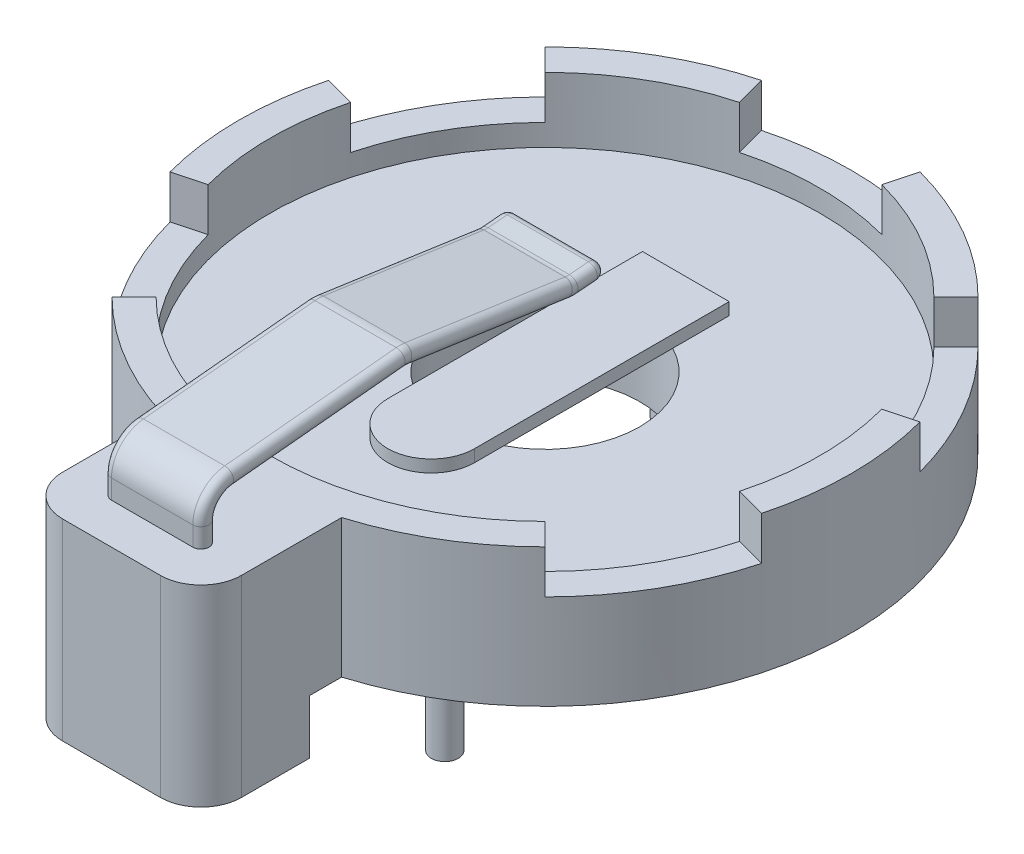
ISO-10303-21;
HEADER;
FILE_DESCRIPTION(('STEP AP214'),'2;1');
FILE_NAME('part.step','',(''),(''),'','','');
FILE_SCHEMA(('AUTOMOTIVE_DESIGN { 1 0 10303 214 1 1 1 1 }'));
ENDSEC;
DATA;
#1=APPLICATION_CONTEXT('core data for automotive mechanical design processes');
#2=APPLICATION_PROTOCOL_DEFINITION('international standard','automotive_design',2000,#1);
#3=PRODUCT_CONTEXT('',#1,'mechanical');
#4=PRODUCT('Part','Part','',(#3));
#5=PRODUCT_RELATED_PRODUCT_CATEGORY('part','',(#4));
#6=PRODUCT_DEFINITION_FORMATION('','',#4);
#7=PRODUCT_DEFINITION_CONTEXT('part definition',#1,'design');
#8=PRODUCT_DEFINITION('design','',#6,#7);
#9=PRODUCT_DEFINITION_SHAPE('','',#8);
#10=(LENGTH_UNIT() NAMED_UNIT(*) SI_UNIT(.MILLI.,.METRE.));
#11=(NAMED_UNIT(*) PLANE_ANGLE_UNIT() SI_UNIT($,.RADIAN.));
#12=(NAMED_UNIT(*) SI_UNIT($,.STERADIAN.) SOLID_ANGLE_UNIT());
#13=UNCERTAINTY_MEASURE_WITH_UNIT(LENGTH_MEASURE(1.E-05),#10,'distance_accuracy_value','');
#14=(GEOMETRIC_REPRESENTATION_CONTEXT(3) GLOBAL_UNCERTAINTY_ASSIGNED_CONTEXT((#13)) GLOBAL_UNIT_ASSIGNED_CONTEXT((#10,
#11,#12)) REPRESENTATION_CONTEXT('',''));
#15=CARTESIAN_POINT('',(0.,0.,0.));
#16=DIRECTION('',(0.,0.,1.));
#17=DIRECTION('',(1.,0.,0.));
#18=AXIS2_PLACEMENT_3D('',#15,#16,#17);
#19=CARTESIAN_POINT('',(0.,2.7,0.));
#20=DIRECTION('',(0.,1.,0.));
#21=DIRECTION('',(0.,0.,1.));
#22=AXIS2_PLACEMENT_3D('',#19,#20,#21);
#23=PLANE('',#22);
#24=CARTESIAN_POINT('',(0.,2.7,0.));
#25=DIRECTION('',(0.,1.,0.));
#26=DIRECTION('',(0.,0.,1.));
#27=AXIS2_PLACEMENT_3D('',#24,#25,#26);
#28=CIRCLE('',#27,10.15);
#29=CARTESIAN_POINT('',(0.,2.7,10.15));
#30=VERTEX_POINT('',#29);
#31=EDGE_CURVE('E697',#30,#30,#28,.T.);
#32=ORIENTED_EDGE('',*,*,#31,.T.);
#33=EDGE_LOOP('',(#32));
#34=FACE_BOUND('',#33,.T.);
#35=CARTESIAN_POINT('',(0.,2.7,0.));
#36=DIRECTION('',(0.,1.,0.));
#37=DIRECTION('',(0.,0.,1.));
#38=AXIS2_PLACEMENT_3D('',#35,#36,#37);
#39=CIRCLE('',#38,3.5);
#40=CARTESIAN_POINT('',(1.6,2.7,3.11287648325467));
#41=VERTEX_POINT('',#40);
#42=CARTESIAN_POINT('',(1.6,2.7,-3.11287648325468));
#43=VERTEX_POINT('',#42);
#44=EDGE_CURVE('E709',#41,#43,#39,.T.);
#45=ORIENTED_EDGE('',*,*,#44,.F.);
#46=DIRECTION('',(0.,0.,-1.));
#47=VECTOR('',#46,1.);
#48=CARTESIAN_POINT('',(1.6,2.7,-5.19845162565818));
#49=LINE('',#48,#47);
#50=CARTESIAN_POINT('',(1.6,2.7,4.20154837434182));
#51=VERTEX_POINT('',#50);
#52=EDGE_CURVE('E543',#51,#41,#49,.T.);
#53=ORIENTED_EDGE('',*,*,#52,.F.);
#54=CARTESIAN_POINT('',(0.,2.7,4.20154837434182));
#55=DIRECTION('',(0.,1.,0.));
#56=DIRECTION('',(0.,0.,1.));
#57=AXIS2_PLACEMENT_3D('',#54,#55,#56);
#58=CIRCLE('',#57,1.6);
#59=CARTESIAN_POINT('',(-1.6,2.7,4.20154837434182));
#60=VERTEX_POINT('',#59);
#61=EDGE_CURVE('E528',#60,#51,#58,.T.);
#62=ORIENTED_EDGE('',*,*,#61,.F.);
#63=DIRECTION('',(0.,0.,-1.));
#64=VECTOR('',#63,1.);
#65=CARTESIAN_POINT('',(-1.6,2.7,0.));
#66=LINE('',#65,#64);
#67=CARTESIAN_POINT('',(-1.6,2.7,3.11287648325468));
#68=VERTEX_POINT('',#67);
#69=EDGE_CURVE('E804',#60,#68,#66,.T.);
#70=ORIENTED_EDGE('',*,*,#69,.T.);
#71=CARTESIAN_POINT('',(-1.6,2.7,-3.11287648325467));
#72=VERTEX_POINT('',#71);
#73=EDGE_CURVE('E1752',#72,#68,#39,.T.);
#74=ORIENTED_EDGE('',*,*,#73,.F.);
#75=DIRECTION('',(0.,0.,1.));
#76=VECTOR('',#75,1.);
#77=CARTESIAN_POINT('',(-1.6,2.7,4.20154837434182));
#78=LINE('',#77,#76);
#79=CARTESIAN_POINT('',(-1.6,2.7,-5.19845162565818));
#80=VERTEX_POINT('',#79);
#81=EDGE_CURVE('E533',#80,#72,#78,.T.);
#82=ORIENTED_EDGE('',*,*,#81,.F.);
#83=DIRECTION('',(-1.,0.,0.));
#84=VECTOR('',#83,1.);
#85=CARTESIAN_POINT('',(-1.6,2.7,-5.19845162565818));
#86=LINE('',#85,#84);
#87=CARTESIAN_POINT('',(1.6,2.7,-5.19845162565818));
#88=VERTEX_POINT('',#87);
#89=EDGE_CURVE('E546',#88,#80,#86,.T.);
#90=ORIENTED_EDGE('',*,*,#89,.F.);
#91=DIRECTION('',(0.,0.,1.));
#92=VECTOR('',#91,1.);
#93=CARTESIAN_POINT('',(1.6,2.7,0.));
#94=LINE('',#93,#92);
#95=EDGE_CURVE('E803',#88,#43,#94,.T.);
#96=ORIENTED_EDGE('',*,*,#95,.T.);
#97=EDGE_LOOP('',(#45,#53,#62,#70,#74,#82,#90,#96));
#98=FACE_BOUND('',#97,.T.);
#99=ADVANCED_FACE('F35',(#34,#98),#23,.T.);
#100=CARTESIAN_POINT('',(-1.79999999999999,-2.,14.5));
#101=DIRECTION('',(0.,-1.,0.));
#102=DIRECTION('',(0.,0.,-1.));
#103=AXIS2_PLACEMENT_3D('',#100,#101,#102);
#104=PLANE('',#103);
#105=CARTESIAN_POINT('',(-1.79999999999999,-2.,14.5));
#106=DIRECTION('',(0.,-1.,0.));
#107=DIRECTION('',(0.,0.,-1.));
#108=AXIS2_PLACEMENT_3D('',#105,#106,#107);
#109=CIRCLE('',#108,1.50000000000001);
#110=CARTESIAN_POINT('',(-1.79999999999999,-2.,16.));
#111=VERTEX_POINT('',#110);
#112=CARTESIAN_POINT('',(-3.3,-2.,14.5));
#113=VERTEX_POINT('',#112);
#114=EDGE_CURVE('E577',#111,#113,#109,.T.);
#115=ORIENTED_EDGE('',*,*,#114,.T.);
#116=DIRECTION('',(0.,0.,-1.));
#117=VECTOR('',#116,1.);
#118=CARTESIAN_POINT('',(-3.3,-2.,14.5));
#119=LINE('',#118,#117);
#120=CARTESIAN_POINT('',(-3.3,-2.,12.));
#121=VERTEX_POINT('',#120);
#122=EDGE_CURVE('E580',#113,#121,#119,.T.);
#123=ORIENTED_EDGE('',*,*,#122,.T.);
#124=DIRECTION('',(1.,0.,0.));
#125=VECTOR('',#124,1.);
#126=CARTESIAN_POINT('',(3.3,-2.,12.));
#127=LINE('',#126,#125);
#128=CARTESIAN_POINT('',(3.3,-2.,12.));
#129=VERTEX_POINT('',#128);
#130=EDGE_CURVE('E582',#121,#129,#127,.T.);
#131=ORIENTED_EDGE('',*,*,#130,.T.);
#132=DIRECTION('',(0.,0.,1.));
#133=VECTOR('',#132,1.);
#134=CARTESIAN_POINT('',(3.3,-2.,14.5));
#135=LINE('',#134,#133);
#136=CARTESIAN_POINT('',(3.3,-2.,14.5));
#137=VERTEX_POINT('',#136);
#138=EDGE_CURVE('E584',#129,#137,#135,.T.);
#139=ORIENTED_EDGE('',*,*,#138,.T.);
#140=CARTESIAN_POINT('',(1.79999999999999,-2.,14.5));
#141=DIRECTION('',(0.,-1.,0.));
#142=DIRECTION('',(0.,0.,1.));
#143=AXIS2_PLACEMENT_3D('',#140,#141,#142);
#144=CIRCLE('',#143,1.50000000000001);
#145=CARTESIAN_POINT('',(1.79999999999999,-2.,16.));
#146=VERTEX_POINT('',#145);
#147=EDGE_CURVE('E587',#137,#146,#144,.T.);
#148=ORIENTED_EDGE('',*,*,#147,.T.);
#149=DIRECTION('',(-1.,0.,0.));
#150=VECTOR('',#149,1.);
#151=CARTESIAN_POINT('',(-1.79999999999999,-2.,16.));
#152=LINE('',#151,#150);
#153=EDGE_CURVE('E590',#146,#111,#152,.T.);
#154=ORIENTED_EDGE('',*,*,#153,.T.);
#155=EDGE_LOOP('',(#115,#123,#131,#139,#148,#154));
#156=FACE_BOUND('',#155,.T.);
#157=CARTESIAN_POINT('',(0.,-2.,13.3));
#158=DIRECTION('',(0.,-1.,0.));
#159=DIRECTION('',(0.,0.,-1.));
#160=AXIS2_PLACEMENT_3D('',#157,#158,#159);
#161=CIRCLE('',#160,0.55);
#162=CARTESIAN_POINT('',(0.,-2.,12.75));
#163=VERTEX_POINT('',#162);
#164=EDGE_CURVE('E561',#163,#163,#161,.T.);
#165=ORIENTED_EDGE('',*,*,#164,.F.);
#166=EDGE_LOOP('',(#165));
#167=FACE_BOUND('',#166,.T.);
#168=ADVANCED_FACE('F948',(#156,#167),#104,.T.);
#169=CARTESIAN_POINT('',(0.,-2.,-6.7));
#170=DIRECTION('',(0.,-1.,0.));
#171=DIRECTION('',(0.,0.,-1.));
#172=AXIS2_PLACEMENT_3D('',#169,#170,#171);
#173=PLANE('',#172);
#174=CARTESIAN_POINT('',(0.,-2.,-6.7));
#175=DIRECTION('',(0.,-1.,0.));
#176=DIRECTION('',(0.,0.,-1.));
#177=AXIS2_PLACEMENT_3D('',#174,#175,#176);
#178=CIRCLE('',#177,2.);
#179=CARTESIAN_POINT('',(0.,-2.,-8.7));
#180=VERTEX_POINT('',#179);
#181=EDGE_CURVE('E571',#180,#180,#178,.T.);
#182=ORIENTED_EDGE('',*,*,#181,.T.);
#183=EDGE_LOOP('',(#182));
#184=FACE_BOUND('',#183,.T.);
#185=CARTESIAN_POINT('',(0.,-2.,-6.7));
#186=DIRECTION('',(0.,-1.,0.));
#187=DIRECTION('',(0.,0.,-1.));
#188=AXIS2_PLACEMENT_3D('',#185,#186,#187);
#189=CIRCLE('',#188,0.55);
#190=CARTESIAN_POINT('',(0.,-2.,-7.25));
#191=VERTEX_POINT('',#190);
#192=EDGE_CURVE('E565',#191,#191,#189,.T.);
#193=ORIENTED_EDGE('',*,*,#192,.F.);
#194=EDGE_LOOP('',(#193));
#195=FACE_BOUND('',#194,.T.);
#196=ADVANCED_FACE('F956',(#184,#195),#173,.T.);
#197=CARTESIAN_POINT('',(-1.8,0.,14.5));
#198=DIRECTION('',(0.,1.,0.));
#199=DIRECTION('',(0.,0.,1.));
#200=AXIS2_PLACEMENT_3D('',#197,#198,#199);
#201=PLANE('',#200);
#202=DIRECTION('',(1.,0.,0.));
#203=VECTOR('',#202,1.);
#204=CARTESIAN_POINT('',(3.3,0.,12.));
#205=LINE('',#204,#203);
#206=CARTESIAN_POINT('',(-3.3,0.,12.));
#207=VERTEX_POINT('',#206);
#208=CARTESIAN_POINT('',(3.3,0.,12.));
#209=VERTEX_POINT('',#208);
#210=EDGE_CURVE('E576',#207,#209,#205,.T.);
#211=ORIENTED_EDGE('',*,*,#210,.F.);
#212=DIRECTION('',(0.,0.,1.));
#213=VECTOR('',#212,1.);
#214=CARTESIAN_POINT('',(-3.3,0.,10.807404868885));
#215=LINE('',#214,#213);
#216=CARTESIAN_POINT('',(-3.3,0.,10.807404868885));
#217=VERTEX_POINT('',#216);
#218=EDGE_CURVE('E714',#217,#207,#215,.T.);
#219=ORIENTED_EDGE('',*,*,#218,.F.);
#220=CARTESIAN_POINT('',(0.,0.,0.));
#221=DIRECTION('',(0.,1.,0.));
#222=DIRECTION('',(0.,0.,1.));
#223=AXIS2_PLACEMENT_3D('',#220,#221,#222);
#224=CIRCLE('',#223,11.3);
#225=CARTESIAN_POINT('',(3.3,0.,10.807404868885));
#226=VERTEX_POINT('',#225);
#227=EDGE_CURVE('E731',#226,#217,#224,.T.);
#228=ORIENTED_EDGE('',*,*,#227,.F.);
#229=DIRECTION('',(0.,0.,-1.));
#230=VECTOR('',#229,1.);
#231=CARTESIAN_POINT('',(3.3,0.,10.807404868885));
#232=LINE('',#231,#230);
#233=EDGE_CURVE('E708',#209,#226,#232,.T.);
#234=ORIENTED_EDGE('',*,*,#233,.F.);
#235=EDGE_LOOP('',(#211,#219,#228,#234));
#236=FACE_BOUND('',#235,.T.);
#237=CARTESIAN_POINT('',(5.05260974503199,0.,8.75137678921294));
#238=DIRECTION('',(0.,1.,0.));
#239=DIRECTION('',(0.,0.,1.));
#240=AXIS2_PLACEMENT_3D('',#237,#238,#239);
#241=CIRCLE('',#240,0.5);
#242=CARTESIAN_POINT('',(5.05260974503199,0.,9.25137678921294));
#243=VERTEX_POINT('',#242);
#244=EDGE_CURVE('E794',#243,#243,#241,.F.);
#245=ORIENTED_EDGE('',*,*,#244,.F.);
#246=EDGE_LOOP('',(#245));
#247=FACE_BOUND('',#246,.T.);
#248=CARTESIAN_POINT('',(0.,0.,0.));
#249=DIRECTION('',(0.,1.,0.));
#250=DIRECTION('',(0.,0.,1.));
#251=AXIS2_PLACEMENT_3D('',#248,#249,#250);
#252=CIRCLE('',#251,3.5);
#253=CARTESIAN_POINT('',(0.,0.,3.5));
#254=VERTEX_POINT('',#253);
#255=EDGE_CURVE('E705',#254,#254,#252,.T.);
#256=ORIENTED_EDGE('',*,*,#255,.T.);
#257=EDGE_LOOP('',(#256));
#258=FACE_BOUND('',#257,.T.);
#259=CARTESIAN_POINT('',(-10.1052194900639,0.,0.));
#260=DIRECTION('',(0.,1.,0.));
#261=DIRECTION('',(0.,0.,1.));
#262=AXIS2_PLACEMENT_3D('',#259,#260,#261);
#263=CIRCLE('',#262,0.500000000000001);
#264=CARTESIAN_POINT('',(-10.1052194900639,0.,0.500000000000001));
#265=VERTEX_POINT('',#264);
#266=EDGE_CURVE('E791',#265,#265,#263,.F.);
#267=ORIENTED_EDGE('',*,*,#266,.F.);
#268=EDGE_LOOP('',(#267));
#269=FACE_BOUND('',#268,.T.);
#270=CARTESIAN_POINT('',(5.05260974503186,0.,-8.75137678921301));
#271=DIRECTION('',(0.,1.,0.));
#272=DIRECTION('',(0.,0.,1.));
#273=AXIS2_PLACEMENT_3D('',#270,#271,#272);
#274=CIRCLE('',#273,0.500000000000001);
#275=CARTESIAN_POINT('',(5.05260974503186,0.,-8.25137678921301));
#276=VERTEX_POINT('',#275);
#277=EDGE_CURVE('E797',#276,#276,#274,.F.);
#278=ORIENTED_EDGE('',*,*,#277,.F.);
#279=EDGE_LOOP('',(#278));
#280=FACE_BOUND('',#279,.T.);
#281=CARTESIAN_POINT('',(0.,0.,-6.7));
#282=DIRECTION('',(0.,1.,0.));
#283=DIRECTION('',(0.,0.,1.));
#284=AXIS2_PLACEMENT_3D('',#281,#282,#283);
#285=CIRCLE('',#284,2.);
#286=CARTESIAN_POINT('',(0.,0.,-4.7));
#287=VERTEX_POINT('',#286);
#288=EDGE_CURVE('E800',#287,#287,#285,.F.);
#289=ORIENTED_EDGE('',*,*,#288,.F.);
#290=EDGE_LOOP('',(#289));
#291=FACE_BOUND('',#290,.T.);
#292=ADVANCED_FACE('F971',(#236,#247,#258,#269,#280,#291),#201,.F.);
#293=CARTESIAN_POINT('',(-1.8,5.1,14.5));
#294=DIRECTION('',(0.,1.,0.));
#295=DIRECTION('',(0.,0.,1.));
#296=AXIS2_PLACEMENT_3D('',#293,#294,#295);
#297=PLANE('',#296);
#298=DIRECTION('',(-0.707106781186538,0.,-0.707106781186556));
#299=VECTOR('',#298,1.);
#300=CARTESIAN_POINT('',(-8.09648237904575,5.1,-8.09648237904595));
#301=LINE('',#300,#299);
#302=CARTESIAN_POINT('',(-7.17713382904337,5.1,-7.17713382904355));
#303=VERTEX_POINT('',#302);
#304=CARTESIAN_POINT('',(-7.99030662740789,5.1,-7.99030662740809));
#305=VERTEX_POINT('',#304);
#306=EDGE_CURVE('E612',#303,#305,#301,.T.);
#307=ORIENTED_EDGE('',*,*,#306,.F.);
#308=CARTESIAN_POINT('',(0.,5.1,0.));
#309=DIRECTION('',(0.,1.,0.));
#310=DIRECTION('',(0.,0.,1.));
#311=AXIS2_PLACEMENT_3D('',#308,#309,#310);
#312=CIRCLE('',#311,10.15);
#313=CARTESIAN_POINT('',(-2.62701330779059,5.1,-9.80414713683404));
#314=VERTEX_POINT('',#313);
#315=EDGE_CURVE('E701',#314,#303,#312,.T.);
#316=ORIENTED_EDGE('',*,*,#315,.F.);
#317=DIRECTION('',(0.258819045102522,0.,0.965925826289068));
#318=VECTOR('',#317,1.);
#319=CARTESIAN_POINT('',(-2.96351823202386,5.1,-11.0600006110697));
#320=LINE('',#319,#318);
#321=CARTESIAN_POINT('',(-2.92465520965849,5.1,-10.9149618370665));
#322=VERTEX_POINT('',#321);
#323=EDGE_CURVE('E678',#322,#314,#320,.T.);
#324=ORIENTED_EDGE('',*,*,#323,.F.);
#325=CARTESIAN_POINT('',(0.,5.1,0.));
#326=DIRECTION('',(0.,1.,0.));
#327=DIRECTION('',(0.,0.,1.));
#328=AXIS2_PLACEMENT_3D('',#325,#326,#327);
#329=CIRCLE('',#328,11.3);
#330=EDGE_CURVE('E727',#322,#305,#329,.T.);
#331=ORIENTED_EDGE('',*,*,#330,.T.);
#332=EDGE_LOOP('',(#307,#316,#324,#331));
#333=FACE_BOUND('',#332,.T.);
#334=ADVANCED_FACE('F892',(#333),#297,.T.);
#335=DIRECTION('',(0.965925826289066,0.,0.258819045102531));
#336=VECTOR('',#335,1.);
#337=CARTESIAN_POINT('',(-11.0600006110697,5.1,-2.96351823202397));
#338=LINE('',#337,#336);
#339=CARTESIAN_POINT('',(-10.9149618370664,5.1,-2.9246552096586));
#340=VERTEX_POINT('',#339);
#341=CARTESIAN_POINT('',(-9.80414713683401,5.1,-2.62701330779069));
#342=VERTEX_POINT('',#341);
#343=EDGE_CURVE('E608',#340,#342,#338,.T.);
#344=ORIENTED_EDGE('',*,*,#343,.F.);
#345=CARTESIAN_POINT('',(-10.9149618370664,5.1,2.92465520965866));
#346=VERTEX_POINT('',#345);
#347=EDGE_CURVE('E726',#340,#346,#329,.T.);
#348=ORIENTED_EDGE('',*,*,#347,.T.);
#349=DIRECTION('',(-0.965925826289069,0.,0.25881904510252));
#350=VECTOR('',#349,1.);
#351=CARTESIAN_POINT('',(-11.0600006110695,5.1,2.96351823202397));
#352=LINE('',#351,#350);
#353=CARTESIAN_POINT('',(-9.804147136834,5.1,2.62701330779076));
#354=VERTEX_POINT('',#353);
#355=EDGE_CURVE('E629',#354,#346,#352,.T.);
#356=ORIENTED_EDGE('',*,*,#355,.F.);
#357=EDGE_CURVE('E704',#342,#354,#312,.T.);
#358=ORIENTED_EDGE('',*,*,#357,.F.);
#359=EDGE_LOOP('',(#344,#348,#356,#358));
#360=FACE_BOUND('',#359,.T.);
#361=ADVANCED_FACE('F863',(#360),#297,.T.);
#362=CARTESIAN_POINT('',(-1.49999999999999,5.1,14.2));
#363=DIRECTION('',(0.,1.,0.));
#364=DIRECTION('',(0.,0.,1.));
#365=AXIS2_PLACEMENT_3D('',#362,#363,#364);
#366=CIRCLE('',#365,0.300000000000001);
#367=CARTESIAN_POINT('',(-1.49999999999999,5.1,13.9));
#368=VERTEX_POINT('',#367);
#369=CARTESIAN_POINT('',(-1.49999999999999,5.1,14.5));
#370=VERTEX_POINT('',#369);
#371=EDGE_CURVE('E403',#368,#370,#366,.T.);
#372=ORIENTED_EDGE('',*,*,#371,.F.);
#373=DIRECTION('',(-1.,0.,0.));
#374=VECTOR('',#373,1.);
#375=CARTESIAN_POINT('',(-1.49999999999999,5.1,13.9));
#376=LINE('',#375,#374);
#377=CARTESIAN_POINT('',(1.49999999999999,5.1,13.9));
#378=VERTEX_POINT('',#377);
#379=EDGE_CURVE('E389',#378,#368,#376,.T.);
#380=ORIENTED_EDGE('',*,*,#379,.F.);
#381=CARTESIAN_POINT('',(1.49999999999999,5.1,14.2));
#382=DIRECTION('',(0.,1.,0.));
#383=DIRECTION('',(0.,0.,-1.));
#384=AXIS2_PLACEMENT_3D('',#381,#382,#383);
#385=CIRCLE('',#384,0.300000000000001);
#386=CARTESIAN_POINT('',(1.49999999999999,5.1,14.5));
#387=VERTEX_POINT('',#386);
#388=EDGE_CURVE('E838',#387,#378,#385,.T.);
#389=ORIENTED_EDGE('',*,*,#388,.F.);
#390=DIRECTION('',(1.,0.,0.));
#391=VECTOR('',#390,1.);
#392=CARTESIAN_POINT('',(-1.49999999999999,5.1,14.5));
#393=LINE('',#392,#391);
#394=EDGE_CURVE('E836',#370,#387,#393,.T.);
#395=ORIENTED_EDGE('',*,*,#394,.F.);
#396=EDGE_LOOP('',(#372,#380,#389,#395));
#397=FACE_BOUND('',#396,.T.);
#398=DIRECTION('',(0.707106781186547,0.,-0.707106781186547));
#399=VECTOR('',#398,1.);
#400=CARTESIAN_POINT('',(-8.09648237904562,5.1,8.09648237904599));
#401=LINE('',#400,#399);
#402=CARTESIAN_POINT('',(-7.9903066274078,5.1,7.99030662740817));
#403=VERTEX_POINT('',#402);
#404=CARTESIAN_POINT('',(-7.17713382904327,5.1,7.17713382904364));
#405=VERTEX_POINT('',#404);
#406=EDGE_CURVE('E625',#403,#405,#401,.T.);
#407=ORIENTED_EDGE('',*,*,#406,.F.);
#408=CARTESIAN_POINT('',(-3.3,5.1,10.807404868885));
#409=VERTEX_POINT('',#408);
#410=EDGE_CURVE('E720',#403,#409,#329,.T.);
#411=ORIENTED_EDGE('',*,*,#410,.T.);
#412=DIRECTION('',(0.,0.,1.));
#413=VECTOR('',#412,1.);
#414=CARTESIAN_POINT('',(-3.3,5.1,10.807404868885));
#415=LINE('',#414,#413);
#416=CARTESIAN_POINT('',(-3.3,5.1,14.5));
#417=VERTEX_POINT('',#416);
#418=EDGE_CURVE('E724',#409,#417,#415,.T.);
#419=ORIENTED_EDGE('',*,*,#418,.T.);
#420=CARTESIAN_POINT('',(-1.8,5.1,14.5));
#421=DIRECTION('',(0.,1.,0.));
#422=DIRECTION('',(0.,0.,1.));
#423=AXIS2_PLACEMENT_3D('',#420,#421,#422);
#424=CIRCLE('',#423,1.5);
#425=CARTESIAN_POINT('',(-1.79999999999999,5.1,16.));
#426=VERTEX_POINT('',#425);
#427=EDGE_CURVE('E710',#417,#426,#424,.T.);
#428=ORIENTED_EDGE('',*,*,#427,.T.);
#429=DIRECTION('',(1.,0.,0.));
#430=VECTOR('',#429,1.);
#431=CARTESIAN_POINT('',(-1.79999999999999,5.1,16.));
#432=LINE('',#431,#430);
#433=CARTESIAN_POINT('',(1.79999999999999,5.1,16.));
#434=VERTEX_POINT('',#433);
#435=EDGE_CURVE('E713',#426,#434,#432,.T.);
#436=ORIENTED_EDGE('',*,*,#435,.T.);
#437=CARTESIAN_POINT('',(1.8,5.1,14.5));
#438=DIRECTION('',(0.,1.,0.));
#439=DIRECTION('',(0.,0.,1.));
#440=AXIS2_PLACEMENT_3D('',#437,#438,#439);
#441=CIRCLE('',#440,1.5);
#442=CARTESIAN_POINT('',(3.3,5.1,14.5));
#443=VERTEX_POINT('',#442);
#444=EDGE_CURVE('E716',#434,#443,#441,.T.);
#445=ORIENTED_EDGE('',*,*,#444,.T.);
#446=DIRECTION('',(0.,0.,-1.));
#447=VECTOR('',#446,1.);
#448=CARTESIAN_POINT('',(3.3,5.1,10.807404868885));
#449=LINE('',#448,#447);
#450=CARTESIAN_POINT('',(3.3,5.1,10.807404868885));
#451=VERTEX_POINT('',#450);
#452=EDGE_CURVE('E718',#443,#451,#449,.T.);
#453=ORIENTED_EDGE('',*,*,#452,.T.);
#454=CARTESIAN_POINT('',(7.99030662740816,5.1,7.99030662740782));
#455=VERTEX_POINT('',#454);
#456=EDGE_CURVE('E721',#451,#455,#329,.T.);
#457=ORIENTED_EDGE('',*,*,#456,.T.);
#458=DIRECTION('',(0.707106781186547,0.,0.707106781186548));
#459=VECTOR('',#458,1.);
#460=CARTESIAN_POINT('',(8.09648237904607,5.1,8.09648237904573));
#461=LINE('',#460,#459);
#462=CARTESIAN_POINT('',(7.17713382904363,5.1,7.17713382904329));
#463=VERTEX_POINT('',#462);
#464=EDGE_CURVE('E647',#463,#455,#461,.T.);
#465=ORIENTED_EDGE('',*,*,#464,.F.);
#466=EDGE_CURVE('E870',#405,#463,#312,.T.);
#467=ORIENTED_EDGE('',*,*,#466,.F.);
#468=EDGE_LOOP('',(#407,#411,#419,#428,#436,#445,#453,#457,#465,#467));
#469=FACE_BOUND('',#468,.T.);
#470=ADVANCED_FACE('F859',(#397,#469),#297,.T.);
#471=DIRECTION('',(-0.965925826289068,0.,-0.258819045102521));
#472=VECTOR('',#471,1.);
#473=CARTESIAN_POINT('',(11.0600006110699,5.1,2.96351823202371));
#474=LINE('',#473,#472);
#475=CARTESIAN_POINT('',(10.9149618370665,5.1,2.9246552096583));
#476=VERTEX_POINT('',#475);
#477=CARTESIAN_POINT('',(9.80414713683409,5.1,2.6270133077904));
#478=VERTEX_POINT('',#477);
#479=EDGE_CURVE('E643',#476,#478,#474,.T.);
#480=ORIENTED_EDGE('',*,*,#479,.F.);
#481=CARTESIAN_POINT('',(10.9149618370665,5.1,-2.92465520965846));
#482=VERTEX_POINT('',#481);
#483=EDGE_CURVE('E725',#476,#482,#329,.T.);
#484=ORIENTED_EDGE('',*,*,#483,.T.);
#485=DIRECTION('',(0.965925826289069,0.,-0.258819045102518));
#486=VECTOR('',#485,1.);
#487=CARTESIAN_POINT('',(11.0600006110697,5.1,-2.96351823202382));
#488=LINE('',#487,#486);
#489=CARTESIAN_POINT('',(9.80414713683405,5.1,-2.62701330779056));
#490=VERTEX_POINT('',#489);
#491=EDGE_CURVE('E664',#490,#482,#488,.T.);
#492=ORIENTED_EDGE('',*,*,#491,.F.);
#493=EDGE_CURVE('E920',#478,#490,#312,.T.);
#494=ORIENTED_EDGE('',*,*,#493,.F.);
#495=EDGE_LOOP('',(#480,#484,#492,#494));
#496=FACE_BOUND('',#495,.T.);
#497=ADVANCED_FACE('F862',(#496),#297,.T.);
#498=CARTESIAN_POINT('',(0.,5.1,0.));
#499=DIRECTION('',(0.,-1.,0.));
#500=DIRECTION('',(0.,0.,-1.));
#501=AXIS2_PLACEMENT_3D('',#498,#499,#500);
#502=CYLINDRICAL_SURFACE('',#501,3.5);
#503=ORIENTED_EDGE('',*,*,#255,.F.);
#504=EDGE_LOOP('',(#503));
#505=FACE_BOUND('',#504,.T.);
#506=ORIENTED_EDGE('',*,*,#44,.T.);
#507=EDGE_CURVE('E751',#43,#72,#39,.T.);
#508=ORIENTED_EDGE('',*,*,#507,.T.);
#509=ORIENTED_EDGE('',*,*,#73,.T.);
#510=EDGE_CURVE('E700',#68,#41,#39,.T.);
#511=ORIENTED_EDGE('',*,*,#510,.T.);
#512=EDGE_LOOP('',(#506,#508,#509,#511));
#513=FACE_BOUND('',#512,.T.);
#514=ADVANCED_FACE('F966',(#505,#513),#502,.F.);
#515=DIRECTION('',(-0.707106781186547,0.,0.707106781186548));
#516=VECTOR('',#515,1.);
#517=CARTESIAN_POINT('',(8.09648237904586,5.1,-8.09648237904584));
#518=LINE('',#517,#516);
#519=CARTESIAN_POINT('',(7.990306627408,5.1,-7.99030662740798));
#520=VERTEX_POINT('',#519);
#521=CARTESIAN_POINT('',(7.17713382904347,5.1,-7.17713382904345));
#522=VERTEX_POINT('',#521);
#523=EDGE_CURVE('E660',#520,#522,#518,.T.);
#524=ORIENTED_EDGE('',*,*,#523,.F.);
#525=CARTESIAN_POINT('',(2.92465520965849,5.1,-10.9149618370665));
#526=VERTEX_POINT('',#525);
#527=EDGE_CURVE('E878',#520,#526,#329,.T.);
#528=ORIENTED_EDGE('',*,*,#527,.T.);
#529=DIRECTION('',(0.258819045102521,0.,-0.965925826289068));
#530=VECTOR('',#529,1.);
#531=CARTESIAN_POINT('',(2.96351823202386,5.1,-11.0600006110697));
#532=LINE('',#531,#530);
#533=CARTESIAN_POINT('',(2.62701330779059,5.1,-9.80414713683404));
#534=VERTEX_POINT('',#533);
#535=EDGE_CURVE('E682',#534,#526,#532,.T.);
#536=ORIENTED_EDGE('',*,*,#535,.F.);
#537=EDGE_CURVE('E696',#522,#534,#312,.T.);
#538=ORIENTED_EDGE('',*,*,#537,.F.);
#539=EDGE_LOOP('',(#524,#528,#536,#538));
#540=FACE_BOUND('',#539,.T.);
#541=ADVANCED_FACE('F919',(#540),#297,.T.);
#542=CARTESIAN_POINT('',(-1.8,5.1,14.5));
#543=DIRECTION('',(0.,-1.,0.));
#544=DIRECTION('',(0.,0.,-1.));
#545=AXIS2_PLACEMENT_3D('',#542,#543,#544);
#546=CYLINDRICAL_SURFACE('',#545,1.5);
#547=DIRECTION('',(0.,-1.,0.));
#548=VECTOR('',#547,1.);
#549=CARTESIAN_POINT('',(-3.3,5.1,14.5));
#550=LINE('',#549,#548);
#551=EDGE_CURVE('E729',#417,#113,#550,.T.);
#552=ORIENTED_EDGE('',*,*,#551,.T.);
#553=ORIENTED_EDGE('',*,*,#114,.F.);
#554=DIRECTION('',(0.,-1.,0.));
#555=VECTOR('',#554,1.);
#556=CARTESIAN_POINT('',(-1.79999999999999,5.1,16.));
#557=LINE('',#556,#555);
#558=EDGE_CURVE('E746',#426,#111,#557,.T.);
#559=ORIENTED_EDGE('',*,*,#558,.F.);
#560=ORIENTED_EDGE('',*,*,#427,.F.);
#561=EDGE_LOOP('',(#552,#553,#559,#560));
#562=FACE_BOUND('',#561,.T.);
#563=ADVANCED_FACE('F970',(#562),#546,.T.);
#564=CARTESIAN_POINT('',(-1.79999999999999,5.1,16.));
#565=DIRECTION('',(0.,0.,-1.));
#566=DIRECTION('',(-1.,0.,0.));
#567=AXIS2_PLACEMENT_3D('',#564,#565,#566);
#568=PLANE('',#567);
#569=ORIENTED_EDGE('',*,*,#558,.T.);
#570=ORIENTED_EDGE('',*,*,#153,.F.);
#571=DIRECTION('',(0.,-1.,0.));
#572=VECTOR('',#571,1.);
#573=CARTESIAN_POINT('',(1.79999999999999,5.1,16.));
#574=LINE('',#573,#572);
#575=EDGE_CURVE('E744',#434,#146,#574,.T.);
#576=ORIENTED_EDGE('',*,*,#575,.F.);
#577=ORIENTED_EDGE('',*,*,#435,.F.);
#578=EDGE_LOOP('',(#569,#570,#576,#577));
#579=FACE_BOUND('',#578,.T.);
#580=ADVANCED_FACE('F987',(#579),#568,.F.);
#581=CARTESIAN_POINT('',(1.8,5.1,14.5));
#582=DIRECTION('',(0.,-1.,0.));
#583=DIRECTION('',(0.,0.,-1.));
#584=AXIS2_PLACEMENT_3D('',#581,#582,#583);
#585=CYLINDRICAL_SURFACE('',#584,1.5);
#586=ORIENTED_EDGE('',*,*,#575,.T.);
#587=ORIENTED_EDGE('',*,*,#147,.F.);
#588=DIRECTION('',(0.,-1.,0.));
#589=VECTOR('',#588,1.);
#590=CARTESIAN_POINT('',(3.3,5.1,14.5));
#591=LINE('',#590,#589);
#592=EDGE_CURVE('E742',#443,#137,#591,.T.);
#593=ORIENTED_EDGE('',*,*,#592,.F.);
#594=ORIENTED_EDGE('',*,*,#444,.F.);
#595=EDGE_LOOP('',(#586,#587,#593,#594));
#596=FACE_BOUND('',#595,.T.);
#597=ADVANCED_FACE('F983',(#596),#585,.T.);
#598=CARTESIAN_POINT('',(3.3,5.1,10.807404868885));
#599=DIRECTION('',(-1.,0.,0.));
#600=DIRECTION('',(0.,0.,1.));
#601=AXIS2_PLACEMENT_3D('',#598,#599,#600);
#602=PLANE('',#601);
#603=ORIENTED_EDGE('',*,*,#592,.T.);
#604=ORIENTED_EDGE('',*,*,#138,.F.);
#605=DIRECTION('',(0.,1.,0.));
#606=VECTOR('',#605,1.);
#607=CARTESIAN_POINT('',(3.3,-2.,12.));
#608=LINE('',#607,#606);
#609=EDGE_CURVE('E593',#129,#209,#608,.T.);
#610=ORIENTED_EDGE('',*,*,#609,.T.);
#611=ORIENTED_EDGE('',*,*,#233,.T.);
#612=DIRECTION('',(0.,-1.,0.));
#613=VECTOR('',#612,1.);
#614=CARTESIAN_POINT('',(3.3,5.1,10.807404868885));
#615=LINE('',#614,#613);
#616=EDGE_CURVE('E739',#451,#226,#615,.T.);
#617=ORIENTED_EDGE('',*,*,#616,.F.);
#618=ORIENTED_EDGE('',*,*,#452,.F.);
#619=EDGE_LOOP('',(#603,#604,#610,#611,#617,#618));
#620=FACE_BOUND('',#619,.T.);
#621=ADVANCED_FACE('F980',(#620),#602,.F.);
#622=CARTESIAN_POINT('',(0.,5.1,0.));
#623=DIRECTION('',(0.,-1.,0.));
#624=DIRECTION('',(0.,0.,-1.));
#625=AXIS2_PLACEMENT_3D('',#622,#623,#624);
#626=CYLINDRICAL_SURFACE('',#625,11.3);
#627=CARTESIAN_POINT('',(0.,3.5,0.));
#628=DIRECTION('',(0.,1.,0.));
#629=DIRECTION('',(0.,0.,1.));
#630=AXIS2_PLACEMENT_3D('',#627,#628,#629);
#631=CIRCLE('',#630,11.3);
#632=CARTESIAN_POINT('',(-7.99030662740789,3.5,-7.99030662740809));
#633=VERTEX_POINT('',#632);
#634=CARTESIAN_POINT('',(-10.9149618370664,3.5,-2.9246552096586));
#635=VERTEX_POINT('',#634);
#636=EDGE_CURVE('E615',#633,#635,#631,.T.);
#637=ORIENTED_EDGE('',*,*,#636,.F.);
#638=DIRECTION('',(0.,-1.,0.));
#639=VECTOR('',#638,1.);
#640=CARTESIAN_POINT('',(-7.99030662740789,5.1,-7.99030662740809));
#641=LINE('',#640,#639);
#642=EDGE_CURVE('E622',#633,#305,#641,.F.);
#643=ORIENTED_EDGE('',*,*,#642,.T.);
#644=ORIENTED_EDGE('',*,*,#330,.F.);
#645=DIRECTION('',(0.,-1.,0.));
#646=VECTOR('',#645,1.);
#647=CARTESIAN_POINT('',(-2.92465520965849,5.1,-10.9149618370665));
#648=LINE('',#647,#646);
#649=CARTESIAN_POINT('',(-2.92465520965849,3.5,-10.9149618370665));
#650=VERTEX_POINT('',#649);
#651=EDGE_CURVE('E690',#322,#650,#648,.T.);
#652=ORIENTED_EDGE('',*,*,#651,.T.);
#653=CARTESIAN_POINT('',(0.,3.5,0.));
#654=DIRECTION('',(0.,1.,0.));
#655=DIRECTION('',(0.,0.,1.));
#656=AXIS2_PLACEMENT_3D('',#653,#654,#655);
#657=CIRCLE('',#656,11.3);
#658=CARTESIAN_POINT('',(2.92465520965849,3.5,-10.9149618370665));
#659=VERTEX_POINT('',#658);
#660=EDGE_CURVE('E685',#659,#650,#657,.T.);
#661=ORIENTED_EDGE('',*,*,#660,.F.);
#662=DIRECTION('',(0.,-1.,0.));
#663=VECTOR('',#662,1.);
#664=CARTESIAN_POINT('',(2.92465520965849,5.1,-10.9149618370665));
#665=LINE('',#664,#663);
#666=EDGE_CURVE('E693',#659,#526,#665,.F.);
#667=ORIENTED_EDGE('',*,*,#666,.T.);
#668=ORIENTED_EDGE('',*,*,#527,.F.);
#669=DIRECTION('',(0.,-1.,0.));
#670=VECTOR('',#669,1.);
#671=CARTESIAN_POINT('',(7.990306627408,5.1,-7.99030662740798));
#672=LINE('',#671,#670);
#673=CARTESIAN_POINT('',(7.990306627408,3.5,-7.99030662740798));
#674=VERTEX_POINT('',#673);
#675=EDGE_CURVE('E672',#520,#674,#672,.T.);
#676=ORIENTED_EDGE('',*,*,#675,.T.);
#677=CARTESIAN_POINT('',(0.,3.5,0.));
#678=DIRECTION('',(0.,1.,0.));
#679=DIRECTION('',(0.,0.,1.));
#680=AXIS2_PLACEMENT_3D('',#677,#678,#679);
#681=CIRCLE('',#680,11.3);
#682=CARTESIAN_POINT('',(10.9149618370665,3.5,-2.92465520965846));
#683=VERTEX_POINT('',#682);
#684=EDGE_CURVE('E667',#683,#674,#681,.T.);
#685=ORIENTED_EDGE('',*,*,#684,.F.);
#686=DIRECTION('',(0.,-1.,0.));
#687=VECTOR('',#686,1.);
#688=CARTESIAN_POINT('',(10.9149618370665,5.1,-2.92465520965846));
#689=LINE('',#688,#687);
#690=EDGE_CURVE('E675',#683,#482,#689,.F.);
#691=ORIENTED_EDGE('',*,*,#690,.T.);
#692=ORIENTED_EDGE('',*,*,#483,.F.);
#693=DIRECTION('',(0.,-1.,0.));
#694=VECTOR('',#693,1.);
#695=CARTESIAN_POINT('',(10.9149618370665,5.1,2.9246552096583));
#696=LINE('',#695,#694);
#697=CARTESIAN_POINT('',(10.9149618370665,3.5,2.9246552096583));
#698=VERTEX_POINT('',#697);
#699=EDGE_CURVE('E654',#476,#698,#696,.T.);
#700=ORIENTED_EDGE('',*,*,#699,.T.);
#701=CARTESIAN_POINT('',(0.,3.5,0.));
#702=DIRECTION('',(0.,1.,0.));
#703=DIRECTION('',(0.,0.,1.));
#704=AXIS2_PLACEMENT_3D('',#701,#702,#703);
#705=CIRCLE('',#704,11.3);
#706=CARTESIAN_POINT('',(7.99030662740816,3.5,7.99030662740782));
#707=VERTEX_POINT('',#706);
#708=EDGE_CURVE('E650',#707,#698,#705,.T.);
#709=ORIENTED_EDGE('',*,*,#708,.F.);
#710=DIRECTION('',(0.,-1.,0.));
#711=VECTOR('',#710,1.);
#712=CARTESIAN_POINT('',(7.99030662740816,5.1,7.99030662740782));
#713=LINE('',#712,#711);
#714=EDGE_CURVE('E657',#707,#455,#713,.F.);
#715=ORIENTED_EDGE('',*,*,#714,.T.);
#716=ORIENTED_EDGE('',*,*,#456,.F.);
#717=ORIENTED_EDGE('',*,*,#616,.T.);
#718=ORIENTED_EDGE('',*,*,#227,.T.);
#719=DIRECTION('',(0.,-1.,0.));
#720=VECTOR('',#719,1.);
#721=CARTESIAN_POINT('',(-3.3,5.1,10.807404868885));
#722=LINE('',#721,#720);
#723=EDGE_CURVE('E736',#409,#217,#722,.T.);
#724=ORIENTED_EDGE('',*,*,#723,.F.);
#725=ORIENTED_EDGE('',*,*,#410,.F.);
#726=DIRECTION('',(0.,-1.,0.));
#727=VECTOR('',#726,1.);
#728=CARTESIAN_POINT('',(-7.9903066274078,5.1,7.99030662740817));
#729=LINE('',#728,#727);
#730=CARTESIAN_POINT('',(-7.9903066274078,3.5,7.99030662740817));
#731=VERTEX_POINT('',#730);
#732=EDGE_CURVE('E637',#403,#731,#729,.T.);
#733=ORIENTED_EDGE('',*,*,#732,.T.);
#734=CARTESIAN_POINT('',(0.,3.5,0.));
#735=DIRECTION('',(0.,1.,0.));
#736=DIRECTION('',(0.,0.,1.));
#737=AXIS2_PLACEMENT_3D('',#734,#735,#736);
#738=CIRCLE('',#737,11.3);
#739=CARTESIAN_POINT('',(-10.9149618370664,3.5,2.92465520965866));
#740=VERTEX_POINT('',#739);
#741=EDGE_CURVE('E632',#740,#731,#738,.T.);
#742=ORIENTED_EDGE('',*,*,#741,.F.);
#743=DIRECTION('',(0.,-1.,0.));
#744=VECTOR('',#743,1.);
#745=CARTESIAN_POINT('',(-10.9149618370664,5.1,2.92465520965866));
#746=LINE('',#745,#744);
#747=EDGE_CURVE('E640',#740,#346,#746,.F.);
#748=ORIENTED_EDGE('',*,*,#747,.T.);
#749=ORIENTED_EDGE('',*,*,#347,.F.);
#750=DIRECTION('',(0.,-1.,0.));
#751=VECTOR('',#750,1.);
#752=CARTESIAN_POINT('',(-10.9149618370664,5.1,-2.9246552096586));
#753=LINE('',#752,#751);
#754=EDGE_CURVE('E619',#340,#635,#753,.T.);
#755=ORIENTED_EDGE('',*,*,#754,.T.);
#756=EDGE_LOOP('',(#637,#643,#644,#652,#661,#667,#668,#676,#685,#691,#692,#700,#709,#715,#716,
#717,#718,#724,#725,#733,#742,#748,#749,#755));
#757=FACE_BOUND('',#756,.T.);
#758=ADVANCED_FACE('F875',(#757),#626,.T.);
#759=CARTESIAN_POINT('',(-3.3,5.1,10.807404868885));
#760=DIRECTION('',(1.,0.,0.));
#761=DIRECTION('',(0.,0.,-1.));
#762=AXIS2_PLACEMENT_3D('',#759,#760,#761);
#763=PLANE('',#762);
#764=ORIENTED_EDGE('',*,*,#218,.T.);
#765=DIRECTION('',(0.,1.,0.));
#766=VECTOR('',#765,1.);
#767=CARTESIAN_POINT('',(-3.3,-2.,12.));
#768=LINE('',#767,#766);
#769=EDGE_CURVE('E597',#121,#207,#768,.T.);
#770=ORIENTED_EDGE('',*,*,#769,.F.);
#771=ORIENTED_EDGE('',*,*,#122,.F.);
#772=ORIENTED_EDGE('',*,*,#551,.F.);
#773=ORIENTED_EDGE('',*,*,#418,.F.);
#774=ORIENTED_EDGE('',*,*,#723,.T.);
#775=EDGE_LOOP('',(#764,#770,#771,#772,#773,#774));
#776=FACE_BOUND('',#775,.T.);
#777=ADVANCED_FACE('F965',(#776),#763,.F.);
#778=CARTESIAN_POINT('',(0.,2.7,0.));
#779=DIRECTION('',(0.,1.,0.));
#780=DIRECTION('',(0.,0.,1.));
#781=AXIS2_PLACEMENT_3D('',#778,#779,#780);
#782=CYLINDRICAL_SURFACE('',#781,10.15);
#783=ORIENTED_EDGE('',*,*,#315,.T.);
#784=DIRECTION('',(0.,1.,0.));
#785=VECTOR('',#784,1.);
#786=CARTESIAN_POINT('',(-7.17713382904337,2.7,-7.17713382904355));
#787=LINE('',#786,#785);
#788=CARTESIAN_POINT('',(-7.17713382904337,3.5,-7.17713382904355));
#789=VERTEX_POINT('',#788);
#790=EDGE_CURVE('E788',#303,#789,#787,.F.);
#791=ORIENTED_EDGE('',*,*,#790,.T.);
#792=CARTESIAN_POINT('',(0.,3.5,0.));
#793=DIRECTION('',(0.,1.,0.));
#794=DIRECTION('',(0.,0.,1.));
#795=AXIS2_PLACEMENT_3D('',#792,#793,#794);
#796=CIRCLE('',#795,10.15);
#797=CARTESIAN_POINT('',(-9.80414713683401,3.5,-2.62701330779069));
#798=VERTEX_POINT('',#797);
#799=EDGE_CURVE('E783',#798,#789,#796,.F.);
#800=ORIENTED_EDGE('',*,*,#799,.F.);
#801=DIRECTION('',(0.,1.,0.));
#802=VECTOR('',#801,1.);
#803=CARTESIAN_POINT('',(-9.80414713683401,2.7,-2.62701330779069));
#804=LINE('',#803,#802);
#805=EDGE_CURVE('E785',#798,#342,#804,.T.);
#806=ORIENTED_EDGE('',*,*,#805,.T.);
#807=ORIENTED_EDGE('',*,*,#357,.T.);
#808=DIRECTION('',(0.,1.,0.));
#809=VECTOR('',#808,1.);
#810=CARTESIAN_POINT('',(-9.804147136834,2.7,2.62701330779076));
#811=LINE('',#810,#809);
#812=CARTESIAN_POINT('',(-9.804147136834,3.5,2.62701330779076));
#813=VERTEX_POINT('',#812);
#814=EDGE_CURVE('E780',#354,#813,#811,.F.);
#815=ORIENTED_EDGE('',*,*,#814,.T.);
#816=CARTESIAN_POINT('',(0.,3.5,0.));
#817=DIRECTION('',(0.,1.,0.));
#818=DIRECTION('',(0.,0.,1.));
#819=AXIS2_PLACEMENT_3D('',#816,#817,#818);
#820=CIRCLE('',#819,10.15);
#821=CARTESIAN_POINT('',(-7.17713382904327,3.5,7.17713382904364));
#822=VERTEX_POINT('',#821);
#823=EDGE_CURVE('E775',#822,#813,#820,.F.);
#824=ORIENTED_EDGE('',*,*,#823,.F.);
#825=DIRECTION('',(0.,1.,0.));
#826=VECTOR('',#825,1.);
#827=CARTESIAN_POINT('',(-7.17713382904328,2.7,7.17713382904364));
#828=LINE('',#827,#826);
#829=EDGE_CURVE('E777',#822,#405,#828,.T.);
#830=ORIENTED_EDGE('',*,*,#829,.T.);
#831=ORIENTED_EDGE('',*,*,#466,.T.);
#832=DIRECTION('',(0.,1.,0.));
#833=VECTOR('',#832,1.);
#834=CARTESIAN_POINT('',(7.17713382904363,2.7,7.17713382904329));
#835=LINE('',#834,#833);
#836=CARTESIAN_POINT('',(7.17713382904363,3.5,7.17713382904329));
#837=VERTEX_POINT('',#836);
#838=EDGE_CURVE('E772',#463,#837,#835,.F.);
#839=ORIENTED_EDGE('',*,*,#838,.T.);
#840=CARTESIAN_POINT('',(0.,3.5,0.));
#841=DIRECTION('',(0.,1.,0.));
#842=DIRECTION('',(0.,0.,1.));
#843=AXIS2_PLACEMENT_3D('',#840,#841,#842);
#844=CIRCLE('',#843,10.15);
#845=CARTESIAN_POINT('',(9.80414713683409,3.5,2.6270133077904));
#846=VERTEX_POINT('',#845);
#847=EDGE_CURVE('E767',#846,#837,#844,.F.);
#848=ORIENTED_EDGE('',*,*,#847,.F.);
#849=DIRECTION('',(0.,1.,0.));
#850=VECTOR('',#849,1.);
#851=CARTESIAN_POINT('',(9.80414713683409,2.7,2.6270133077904));
#852=LINE('',#851,#850);
#853=EDGE_CURVE('E769',#846,#478,#852,.T.);
#854=ORIENTED_EDGE('',*,*,#853,.T.);
#855=ORIENTED_EDGE('',*,*,#493,.T.);
#856=DIRECTION('',(0.,1.,0.));
#857=VECTOR('',#856,1.);
#858=CARTESIAN_POINT('',(9.80414713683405,2.7,-2.62701330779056));
#859=LINE('',#858,#857);
#860=CARTESIAN_POINT('',(9.80414713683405,3.5,-2.62701330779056));
#861=VERTEX_POINT('',#860);
#862=EDGE_CURVE('E764',#490,#861,#859,.F.);
#863=ORIENTED_EDGE('',*,*,#862,.T.);
#864=CARTESIAN_POINT('',(0.,3.5,0.));
#865=DIRECTION('',(0.,1.,0.));
#866=DIRECTION('',(0.,0.,1.));
#867=AXIS2_PLACEMENT_3D('',#864,#865,#866);
#868=CIRCLE('',#867,10.15);
#869=CARTESIAN_POINT('',(7.17713382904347,3.5,-7.17713382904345));
#870=VERTEX_POINT('',#869);
#871=EDGE_CURVE('E759',#870,#861,#868,.F.);
#872=ORIENTED_EDGE('',*,*,#871,.F.);
#873=DIRECTION('',(0.,1.,0.));
#874=VECTOR('',#873,1.);
#875=CARTESIAN_POINT('',(7.17713382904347,2.7,-7.17713382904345));
#876=LINE('',#875,#874);
#877=EDGE_CURVE('E761',#870,#522,#876,.T.);
#878=ORIENTED_EDGE('',*,*,#877,.T.);
#879=ORIENTED_EDGE('',*,*,#537,.T.);
#880=DIRECTION('',(0.,1.,0.));
#881=VECTOR('',#880,1.);
#882=CARTESIAN_POINT('',(2.62701330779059,2.7,-9.80414713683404));
#883=LINE('',#882,#881);
#884=CARTESIAN_POINT('',(2.62701330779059,3.5,-9.80414713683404));
#885=VERTEX_POINT('',#884);
#886=EDGE_CURVE('E756',#534,#885,#883,.F.);
#887=ORIENTED_EDGE('',*,*,#886,.T.);
#888=CARTESIAN_POINT('',(0.,3.5,0.));
#889=DIRECTION('',(0.,1.,0.));
#890=DIRECTION('',(0.,0.,1.));
#891=AXIS2_PLACEMENT_3D('',#888,#889,#890);
#892=CIRCLE('',#891,10.15);
#893=CARTESIAN_POINT('',(-2.62701330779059,3.5,-9.80414713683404));
#894=VERTEX_POINT('',#893);
#895=EDGE_CURVE('E748',#894,#885,#892,.F.);
#896=ORIENTED_EDGE('',*,*,#895,.F.);
#897=DIRECTION('',(0.,1.,0.));
#898=VECTOR('',#897,1.);
#899=CARTESIAN_POINT('',(-2.62701330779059,2.7,-9.80414713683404));
#900=LINE('',#899,#898);
#901=EDGE_CURVE('E753',#894,#314,#900,.T.);
#902=ORIENTED_EDGE('',*,*,#901,.T.);
#903=EDGE_LOOP('',(#783,#791,#800,#806,#807,#815,#824,#830,#831,#839,#848,#854,#855,#863,#872,
#878,#879,#887,#896,#902));
#904=FACE_BOUND('',#903,.T.);
#905=ORIENTED_EDGE('',*,*,#31,.F.);
#906=EDGE_LOOP('',(#905));
#907=FACE_BOUND('',#906,.T.);
#908=ADVANCED_FACE('F904',(#904,#907),#782,.F.);
#909=CARTESIAN_POINT('',(2.96351823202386,3.5,-11.0600006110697));
#910=DIRECTION('',(0.965925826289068,0.,0.258819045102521));
#911=DIRECTION('',(0.258819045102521,0.,-0.965925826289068));
#912=AXIS2_PLACEMENT_3D('',#909,#910,#911);
#913=PLANE('',#912);
#914=DIRECTION('',(0.258819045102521,0.,-0.965925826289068));
#915=VECTOR('',#914,1.);
#916=CARTESIAN_POINT('',(2.96351823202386,3.5,-11.0600006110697));
#917=LINE('',#916,#915);
#918=EDGE_CURVE('E681',#885,#659,#917,.T.);
#919=ORIENTED_EDGE('',*,*,#918,.F.);
#920=ORIENTED_EDGE('',*,*,#886,.F.);
#921=ORIENTED_EDGE('',*,*,#535,.T.);
#922=ORIENTED_EDGE('',*,*,#666,.F.);
#923=EDGE_LOOP('',(#919,#920,#921,#922));
#924=FACE_BOUND('',#923,.T.);
#925=ADVANCED_FACE('F916',(#924),#913,.F.);
#926=CARTESIAN_POINT('',(-2.96351823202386,3.5,-11.0600006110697));
#927=DIRECTION('',(-0.965925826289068,0.,0.258819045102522));
#928=DIRECTION('',(0.258819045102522,0.,0.965925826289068));
#929=AXIS2_PLACEMENT_3D('',#926,#927,#928);
#930=PLANE('',#929);
#931=ORIENTED_EDGE('',*,*,#323,.T.);
#932=ORIENTED_EDGE('',*,*,#901,.F.);
#933=DIRECTION('',(0.258819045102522,0.,0.965925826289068));
#934=VECTOR('',#933,1.);
#935=CARTESIAN_POINT('',(-2.96351823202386,3.5,-11.0600006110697));
#936=LINE('',#935,#934);
#937=EDGE_CURVE('E679',#650,#894,#936,.T.);
#938=ORIENTED_EDGE('',*,*,#937,.F.);
#939=ORIENTED_EDGE('',*,*,#651,.F.);
#940=EDGE_LOOP('',(#931,#932,#938,#939));
#941=FACE_BOUND('',#940,.T.);
#942=ADVANCED_FACE('F911',(#941),#930,.F.);
#943=CARTESIAN_POINT('',(0.,3.5,0.));
#944=DIRECTION('',(0.,1.,0.));
#945=DIRECTION('',(0.,0.,1.));
#946=AXIS2_PLACEMENT_3D('',#943,#944,#945);
#947=PLANE('',#946);
#948=ORIENTED_EDGE('',*,*,#660,.T.);
#949=ORIENTED_EDGE('',*,*,#937,.T.);
#950=ORIENTED_EDGE('',*,*,#895,.T.);
#951=ORIENTED_EDGE('',*,*,#918,.T.);
#952=EDGE_LOOP('',(#948,#949,#950,#951));
#953=FACE_BOUND('',#952,.T.);
#954=ADVANCED_FACE('F913',(#953),#947,.T.);
#955=CARTESIAN_POINT('',(11.0600006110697,3.5,-2.96351823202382));
#956=DIRECTION('',(0.258819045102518,0.,0.965925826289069));
#957=DIRECTION('',(0.965925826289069,0.,-0.258819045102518));
#958=AXIS2_PLACEMENT_3D('',#955,#956,#957);
#959=PLANE('',#958);
#960=DIRECTION('',(0.965925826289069,0.,-0.258819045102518));
#961=VECTOR('',#960,1.);
#962=CARTESIAN_POINT('',(11.0600006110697,3.5,-2.96351823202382));
#963=LINE('',#962,#961);
#964=EDGE_CURVE('E663',#861,#683,#963,.T.);
#965=ORIENTED_EDGE('',*,*,#964,.F.);
#966=ORIENTED_EDGE('',*,*,#862,.F.);
#967=ORIENTED_EDGE('',*,*,#491,.T.);
#968=ORIENTED_EDGE('',*,*,#690,.F.);
#969=EDGE_LOOP('',(#965,#966,#967,#968));
#970=FACE_BOUND('',#969,.T.);
#971=ADVANCED_FACE('F1520',(#970),#959,.F.);
#972=CARTESIAN_POINT('',(8.09648237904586,3.5,-8.09648237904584));
#973=DIRECTION('',(-0.707106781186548,0.,-0.707106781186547));
#974=DIRECTION('',(-0.707106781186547,0.,0.707106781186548));
#975=AXIS2_PLACEMENT_3D('',#972,#973,#974);
#976=PLANE('',#975);
#977=ORIENTED_EDGE('',*,*,#523,.T.);
#978=ORIENTED_EDGE('',*,*,#877,.F.);
#979=DIRECTION('',(-0.707106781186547,0.,0.707106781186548));
#980=VECTOR('',#979,1.);
#981=CARTESIAN_POINT('',(8.09648237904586,3.5,-8.09648237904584));
#982=LINE('',#981,#980);
#983=EDGE_CURVE('E661',#674,#870,#982,.T.);
#984=ORIENTED_EDGE('',*,*,#983,.F.);
#985=ORIENTED_EDGE('',*,*,#675,.F.);
#986=EDGE_LOOP('',(#977,#978,#984,#985));
#987=FACE_BOUND('',#986,.T.);
#988=ADVANCED_FACE('F1527',(#987),#976,.F.);
#989=CARTESIAN_POINT('',(0.,3.5,0.));
#990=DIRECTION('',(0.,1.,0.));
#991=DIRECTION('',(0.,0.,1.));
#992=AXIS2_PLACEMENT_3D('',#989,#990,#991);
#993=PLANE('',#992);
#994=ORIENTED_EDGE('',*,*,#684,.T.);
#995=ORIENTED_EDGE('',*,*,#983,.T.);
#996=ORIENTED_EDGE('',*,*,#871,.T.);
#997=ORIENTED_EDGE('',*,*,#964,.T.);
#998=EDGE_LOOP('',(#994,#995,#996,#997));
#999=FACE_BOUND('',#998,.T.);
#1000=ADVANCED_FACE('F1535',(#999),#993,.T.);
#1001=CARTESIAN_POINT('',(8.09648237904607,3.5,8.09648237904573));
#1002=DIRECTION('',(-0.707106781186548,0.,0.707106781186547));
#1003=DIRECTION('',(0.707106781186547,0.,0.707106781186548));
#1004=AXIS2_PLACEMENT_3D('',#1001,#1002,#1003);
#1005=PLANE('',#1004);
#1006=DIRECTION('',(0.707106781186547,0.,0.707106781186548));
#1007=VECTOR('',#1006,1.);
#1008=CARTESIAN_POINT('',(8.09648237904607,3.5,8.09648237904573));
#1009=LINE('',#1008,#1007);
#1010=EDGE_CURVE('E646',#837,#707,#1009,.T.);
#1011=ORIENTED_EDGE('',*,*,#1010,.F.);
#1012=ORIENTED_EDGE('',*,*,#838,.F.);
#1013=ORIENTED_EDGE('',*,*,#464,.T.);
#1014=ORIENTED_EDGE('',*,*,#714,.F.);
#1015=EDGE_LOOP('',(#1011,#1012,#1013,#1014));
#1016=FACE_BOUND('',#1015,.T.);
#1017=ADVANCED_FACE('F1543',(#1016),#1005,.F.);
#1018=CARTESIAN_POINT('',(11.0600006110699,3.5,2.96351823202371));
#1019=DIRECTION('',(0.258819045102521,0.,-0.965925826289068));
#1020=DIRECTION('',(-0.965925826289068,0.,-0.258819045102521));
#1021=AXIS2_PLACEMENT_3D('',#1018,#1019,#1020);
#1022=PLANE('',#1021);
#1023=ORIENTED_EDGE('',*,*,#479,.T.);
#1024=ORIENTED_EDGE('',*,*,#853,.F.);
#1025=DIRECTION('',(-0.965925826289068,0.,-0.258819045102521));
#1026=VECTOR('',#1025,1.);
#1027=CARTESIAN_POINT('',(11.0600006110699,3.5,2.96351823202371));
#1028=LINE('',#1027,#1026);
#1029=EDGE_CURVE('E644',#698,#846,#1028,.T.);
#1030=ORIENTED_EDGE('',*,*,#1029,.F.);
#1031=ORIENTED_EDGE('',*,*,#699,.F.);
#1032=EDGE_LOOP('',(#1023,#1024,#1030,#1031));
#1033=FACE_BOUND('',#1032,.T.);
#1034=ADVANCED_FACE('F1551',(#1033),#1022,.F.);
#1035=CARTESIAN_POINT('',(2.20777760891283E-13,3.5,-1.27466099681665E-13));
#1036=DIRECTION('',(0.,1.,0.));
#1037=DIRECTION('',(0.,0.,1.));
#1038=AXIS2_PLACEMENT_3D('',#1035,#1036,#1037);
#1039=PLANE('',#1038);
#1040=ORIENTED_EDGE('',*,*,#708,.T.);
#1041=ORIENTED_EDGE('',*,*,#1029,.T.);
#1042=ORIENTED_EDGE('',*,*,#847,.T.);
#1043=ORIENTED_EDGE('',*,*,#1010,.T.);
#1044=EDGE_LOOP('',(#1040,#1041,#1042,#1043));
#1045=FACE_BOUND('',#1044,.T.);
#1046=ADVANCED_FACE('F944',(#1045),#1039,.T.);
#1047=CARTESIAN_POINT('',(-11.0600006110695,3.5,2.96351823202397));
#1048=DIRECTION('',(-0.25881904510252,0.,-0.965925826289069));
#1049=DIRECTION('',(-0.965925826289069,0.,0.25881904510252));
#1050=AXIS2_PLACEMENT_3D('',#1047,#1048,#1049);
#1051=PLANE('',#1050);
#1052=DIRECTION('',(-0.965925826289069,0.,0.25881904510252));
#1053=VECTOR('',#1052,1.);
#1054=CARTESIAN_POINT('',(-11.0600006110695,3.5,2.96351823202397));
#1055=LINE('',#1054,#1053);
#1056=EDGE_CURVE('E628',#813,#740,#1055,.T.);
#1057=ORIENTED_EDGE('',*,*,#1056,.F.);
#1058=ORIENTED_EDGE('',*,*,#814,.F.);
#1059=ORIENTED_EDGE('',*,*,#355,.T.);
#1060=ORIENTED_EDGE('',*,*,#747,.F.);
#1061=EDGE_LOOP('',(#1057,#1058,#1059,#1060));
#1062=FACE_BOUND('',#1061,.T.);
#1063=ADVANCED_FACE('F931',(#1062),#1051,.F.);
#1064=CARTESIAN_POINT('',(-8.09648237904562,3.5,8.09648237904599));
#1065=DIRECTION('',(0.707106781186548,0.,0.707106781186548));
#1066=DIRECTION('',(0.707106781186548,0.,-0.707106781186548));
#1067=AXIS2_PLACEMENT_3D('',#1064,#1065,#1066);
#1068=PLANE('',#1067);
#1069=ORIENTED_EDGE('',*,*,#406,.T.);
#1070=ORIENTED_EDGE('',*,*,#829,.F.);
#1071=DIRECTION('',(0.707106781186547,0.,-0.707106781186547));
#1072=VECTOR('',#1071,1.);
#1073=CARTESIAN_POINT('',(-8.09648237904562,3.5,8.09648237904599));
#1074=LINE('',#1073,#1072);
#1075=EDGE_CURVE('E626',#731,#822,#1074,.T.);
#1076=ORIENTED_EDGE('',*,*,#1075,.F.);
#1077=ORIENTED_EDGE('',*,*,#732,.F.);
#1078=EDGE_LOOP('',(#1069,#1070,#1076,#1077));
#1079=FACE_BOUND('',#1078,.T.);
#1080=ADVANCED_FACE('F936',(#1079),#1068,.F.);
#1081=CARTESIAN_POINT('',(0.,3.5,0.));
#1082=DIRECTION('',(0.,1.,0.));
#1083=DIRECTION('',(0.,0.,1.));
#1084=AXIS2_PLACEMENT_3D('',#1081,#1082,#1083);
#1085=PLANE('',#1084);
#1086=ORIENTED_EDGE('',*,*,#741,.T.);
#1087=ORIENTED_EDGE('',*,*,#1075,.T.);
#1088=ORIENTED_EDGE('',*,*,#823,.T.);
#1089=ORIENTED_EDGE('',*,*,#1056,.T.);
#1090=EDGE_LOOP('',(#1086,#1087,#1088,#1089));
#1091=FACE_BOUND('',#1090,.T.);
#1092=ADVANCED_FACE('F934',(#1091),#1085,.T.);
#1093=CARTESIAN_POINT('',(-8.09648237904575,3.5,-8.09648237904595));
#1094=DIRECTION('',(0.707106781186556,0.,-0.707106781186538));
#1095=DIRECTION('',(-0.707106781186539,0.,-0.707106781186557));
#1096=AXIS2_PLACEMENT_3D('',#1093,#1094,#1095);
#1097=PLANE('',#1096);
#1098=DIRECTION('',(-0.707106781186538,0.,-0.707106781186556));
#1099=VECTOR('',#1098,1.);
#1100=CARTESIAN_POINT('',(-8.09648237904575,3.5,-8.09648237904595));
#1101=LINE('',#1100,#1099);
#1102=EDGE_CURVE('E611',#789,#633,#1101,.T.);
#1103=ORIENTED_EDGE('',*,*,#1102,.F.);
#1104=ORIENTED_EDGE('',*,*,#790,.F.);
#1105=ORIENTED_EDGE('',*,*,#306,.T.);
#1106=ORIENTED_EDGE('',*,*,#642,.F.);
#1107=EDGE_LOOP('',(#1103,#1104,#1105,#1106));
#1108=FACE_BOUND('',#1107,.T.);
#1109=ADVANCED_FACE('F897',(#1108),#1097,.F.);
#1110=CARTESIAN_POINT('',(-11.0600006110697,3.5,-2.96351823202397));
#1111=DIRECTION('',(-0.258819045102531,0.,0.965925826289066));
#1112=DIRECTION('',(0.965925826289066,0.,0.258819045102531));
#1113=AXIS2_PLACEMENT_3D('',#1110,#1111,#1112);
#1114=PLANE('',#1113);
#1115=ORIENTED_EDGE('',*,*,#343,.T.);
#1116=ORIENTED_EDGE('',*,*,#805,.F.);
#1117=DIRECTION('',(0.965925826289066,0.,0.258819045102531));
#1118=VECTOR('',#1117,1.);
#1119=CARTESIAN_POINT('',(-11.0600006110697,3.5,-2.96351823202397));
#1120=LINE('',#1119,#1118);
#1121=EDGE_CURVE('E609',#635,#798,#1120,.T.);
#1122=ORIENTED_EDGE('',*,*,#1121,.F.);
#1123=ORIENTED_EDGE('',*,*,#754,.F.);
#1124=EDGE_LOOP('',(#1115,#1116,#1122,#1123));
#1125=FACE_BOUND('',#1124,.T.);
#1126=ADVANCED_FACE('F1167',(#1125),#1114,.F.);
#1127=CARTESIAN_POINT('',(0.,3.5,0.));
#1128=DIRECTION('',(0.,1.,0.));
#1129=DIRECTION('',(0.,0.,1.));
#1130=AXIS2_PLACEMENT_3D('',#1127,#1128,#1129);
#1131=PLANE('',#1130);
#1132=ORIENTED_EDGE('',*,*,#636,.T.);
#1133=ORIENTED_EDGE('',*,*,#1121,.T.);
#1134=ORIENTED_EDGE('',*,*,#799,.T.);
#1135=ORIENTED_EDGE('',*,*,#1102,.T.);
#1136=EDGE_LOOP('',(#1132,#1133,#1134,#1135));
#1137=FACE_BOUND('',#1136,.T.);
#1138=ADVANCED_FACE('F899',(#1137),#1131,.T.);
#1139=CARTESIAN_POINT('',(-10.1052194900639,-2.5,0.));
#1140=DIRECTION('',(0.,1.,0.));
#1141=DIRECTION('',(0.,0.,1.));
#1142=AXIS2_PLACEMENT_3D('',#1139,#1140,#1141);
#1143=CYLINDRICAL_SURFACE('',#1142,0.500000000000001);
#1144=CARTESIAN_POINT('',(-10.1052194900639,-2.5,0.));
#1145=DIRECTION('',(0.,-1.,0.));
#1146=DIRECTION('',(0.,0.,-1.));
#1147=AXIS2_PLACEMENT_3D('',#1144,#1145,#1146);
#1148=CIRCLE('',#1147,0.500000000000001);
#1149=CARTESIAN_POINT('',(-10.1052194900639,-2.5,-0.500000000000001));
#1150=VERTEX_POINT('',#1149);
#1151=EDGE_CURVE('E605',#1150,#1150,#1148,.T.);
#1152=ORIENTED_EDGE('',*,*,#1151,.F.);
#1153=EDGE_LOOP('',(#1152));
#1154=FACE_BOUND('',#1153,.T.);
#1155=ORIENTED_EDGE('',*,*,#266,.T.);
#1156=EDGE_LOOP('',(#1155));
#1157=FACE_BOUND('',#1156,.T.);
#1158=ADVANCED_FACE('F1160',(#1154,#1157),#1143,.T.);
#1159=CARTESIAN_POINT('',(-10.1052194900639,-2.5,0.));
#1160=DIRECTION('',(0.,-1.,0.));
#1161=DIRECTION('',(0.,0.,-1.));
#1162=AXIS2_PLACEMENT_3D('',#1159,#1160,#1161);
#1163=PLANE('',#1162);
#1164=ORIENTED_EDGE('',*,*,#1151,.T.);
#1165=EDGE_LOOP('',(#1164));
#1166=FACE_BOUND('',#1165,.T.);
#1167=ADVANCED_FACE('F1156',(#1166),#1163,.T.);
#1168=CARTESIAN_POINT('',(5.05260974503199,-2.5,8.75137678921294));
#1169=DIRECTION('',(0.,1.,0.));
#1170=DIRECTION('',(0.,0.,1.));
#1171=AXIS2_PLACEMENT_3D('',#1168,#1169,#1170);
#1172=CYLINDRICAL_SURFACE('',#1171,0.5);
#1173=CARTESIAN_POINT('',(5.05260974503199,-2.5,8.75137678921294));
#1174=DIRECTION('',(0.,-1.,0.));
#1175=DIRECTION('',(0.,0.,-1.));
#1176=AXIS2_PLACEMENT_3D('',#1173,#1174,#1175);
#1177=CIRCLE('',#1176,0.5);
#1178=CARTESIAN_POINT('',(5.05260974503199,-2.5,8.25137678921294));
#1179=VERTEX_POINT('',#1178);
#1180=EDGE_CURVE('E602',#1179,#1179,#1177,.T.);
#1181=ORIENTED_EDGE('',*,*,#1180,.F.);
#1182=EDGE_LOOP('',(#1181));
#1183=FACE_BOUND('',#1182,.T.);
#1184=ORIENTED_EDGE('',*,*,#244,.T.);
#1185=EDGE_LOOP('',(#1184));
#1186=FACE_BOUND('',#1185,.T.);
#1187=ADVANCED_FACE('F1152',(#1183,#1186),#1172,.T.);
#1188=CARTESIAN_POINT('',(5.05260974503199,-2.5,8.75137678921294));
#1189=DIRECTION('',(0.,-1.,0.));
#1190=DIRECTION('',(0.,0.,-1.));
#1191=AXIS2_PLACEMENT_3D('',#1188,#1189,#1190);
#1192=PLANE('',#1191);
#1193=ORIENTED_EDGE('',*,*,#1180,.T.);
#1194=EDGE_LOOP('',(#1193));
#1195=FACE_BOUND('',#1194,.T.);
#1196=ADVANCED_FACE('F1148',(#1195),#1192,.T.);
#1197=CARTESIAN_POINT('',(5.05260974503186,-2.5,-8.75137678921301));
#1198=DIRECTION('',(0.,1.,0.));
#1199=DIRECTION('',(0.,0.,1.));
#1200=AXIS2_PLACEMENT_3D('',#1197,#1198,#1199);
#1201=CYLINDRICAL_SURFACE('',#1200,0.500000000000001);
#1202=CARTESIAN_POINT('',(5.05260974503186,-2.5,-8.75137678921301));
#1203=DIRECTION('',(0.,-1.,0.));
#1204=DIRECTION('',(0.,0.,-1.));
#1205=AXIS2_PLACEMENT_3D('',#1202,#1203,#1204);
#1206=CIRCLE('',#1205,0.500000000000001);
#1207=CARTESIAN_POINT('',(5.05260974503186,-2.5,-9.25137678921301));
#1208=VERTEX_POINT('',#1207);
#1209=EDGE_CURVE('E599',#1208,#1208,#1206,.T.);
#1210=ORIENTED_EDGE('',*,*,#1209,.F.);
#1211=EDGE_LOOP('',(#1210));
#1212=FACE_BOUND('',#1211,.T.);
#1213=ORIENTED_EDGE('',*,*,#277,.T.);
#1214=EDGE_LOOP('',(#1213));
#1215=FACE_BOUND('',#1214,.T.);
#1216=ADVANCED_FACE('F1144',(#1212,#1215),#1201,.T.);
#1217=CARTESIAN_POINT('',(5.05260974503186,-2.5,-8.75137678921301));
#1218=DIRECTION('',(0.,-1.,0.));
#1219=DIRECTION('',(0.,0.,-1.));
#1220=AXIS2_PLACEMENT_3D('',#1217,#1218,#1219);
#1221=PLANE('',#1220);
#1222=ORIENTED_EDGE('',*,*,#1209,.T.);
#1223=EDGE_LOOP('',(#1222));
#1224=FACE_BOUND('',#1223,.T.);
#1225=ADVANCED_FACE('F1140',(#1224),#1221,.T.);
#1226=CARTESIAN_POINT('',(3.3,-2.,12.));
#1227=DIRECTION('',(0.,0.,1.));
#1228=DIRECTION('',(1.,0.,0.));
#1229=AXIS2_PLACEMENT_3D('',#1226,#1227,#1228);
#1230=PLANE('',#1229);
#1231=ORIENTED_EDGE('',*,*,#210,.T.);
#1232=ORIENTED_EDGE('',*,*,#609,.F.);
#1233=ORIENTED_EDGE('',*,*,#130,.F.);
#1234=ORIENTED_EDGE('',*,*,#769,.T.);
#1235=EDGE_LOOP('',(#1231,#1232,#1233,#1234));
#1236=FACE_BOUND('',#1235,.T.);
#1237=ADVANCED_FACE('F1135',(#1236),#1230,.F.);
#1238=CARTESIAN_POINT('',(0.,-2.,-6.7));
#1239=DIRECTION('',(0.,1.,0.));
#1240=DIRECTION('',(0.,0.,1.));
#1241=AXIS2_PLACEMENT_3D('',#1238,#1239,#1240);
#1242=CYLINDRICAL_SURFACE('',#1241,2.);
#1243=ORIENTED_EDGE('',*,*,#181,.F.);
#1244=EDGE_LOOP('',(#1243));
#1245=FACE_BOUND('',#1244,.T.);
#1246=ORIENTED_EDGE('',*,*,#288,.T.);
#1247=EDGE_LOOP('',(#1246));
#1248=FACE_BOUND('',#1247,.T.);
#1249=ADVANCED_FACE('F1129',(#1245,#1248),#1242,.T.);
#1250=CARTESIAN_POINT('',(0.,-4.1,-6.7));
#1251=DIRECTION('',(0.,1.,0.));
#1252=DIRECTION('',(0.,0.,1.));
#1253=AXIS2_PLACEMENT_3D('',#1250,#1251,#1252);
#1254=CYLINDRICAL_SURFACE('',#1253,0.55);
#1255=CARTESIAN_POINT('',(0.,-4.1,-6.7));
#1256=DIRECTION('',(0.,-1.,0.));
#1257=DIRECTION('',(0.,0.,-1.));
#1258=AXIS2_PLACEMENT_3D('',#1255,#1256,#1257);
#1259=CIRCLE('',#1258,0.55);
#1260=CARTESIAN_POINT('',(0.,-4.1,-7.25));
#1261=VERTEX_POINT('',#1260);
#1262=EDGE_CURVE('E568',#1261,#1261,#1259,.T.);
#1263=ORIENTED_EDGE('',*,*,#1262,.F.);
#1264=EDGE_LOOP('',(#1263));
#1265=FACE_BOUND('',#1264,.T.);
#1266=ORIENTED_EDGE('',*,*,#192,.T.);
#1267=EDGE_LOOP('',(#1266));
#1268=FACE_BOUND('',#1267,.T.);
#1269=ADVANCED_FACE('F1125',(#1265,#1268),#1254,.T.);
#1270=CARTESIAN_POINT('',(0.,-4.1,-6.7));
#1271=DIRECTION('',(0.,-1.,0.));
#1272=DIRECTION('',(0.,0.,-1.));
#1273=AXIS2_PLACEMENT_3D('',#1270,#1271,#1272);
#1274=PLANE('',#1273);
#1275=ORIENTED_EDGE('',*,*,#1262,.T.);
#1276=EDGE_LOOP('',(#1275));
#1277=FACE_BOUND('',#1276,.T.);
#1278=ADVANCED_FACE('F1121',(#1277),#1274,.T.);
#1279=CARTESIAN_POINT('',(0.,-4.1,13.3));
#1280=DIRECTION('',(0.,1.,0.));
#1281=DIRECTION('',(0.,0.,1.));
#1282=AXIS2_PLACEMENT_3D('',#1279,#1280,#1281);
#1283=CYLINDRICAL_SURFACE('',#1282,0.55);
#1284=CARTESIAN_POINT('',(0.,-4.1,13.3));
#1285=DIRECTION('',(0.,-1.,0.));
#1286=DIRECTION('',(0.,0.,-1.));
#1287=AXIS2_PLACEMENT_3D('',#1284,#1285,#1286);
#1288=CIRCLE('',#1287,0.55);
#1289=CARTESIAN_POINT('',(0.,-4.1,12.75));
#1290=VERTEX_POINT('',#1289);
#1291=EDGE_CURVE('E562',#1290,#1290,#1288,.T.);
#1292=ORIENTED_EDGE('',*,*,#1291,.F.);
#1293=EDGE_LOOP('',(#1292));
#1294=FACE_BOUND('',#1293,.T.);
#1295=ORIENTED_EDGE('',*,*,#164,.T.);
#1296=EDGE_LOOP('',(#1295));
#1297=FACE_BOUND('',#1296,.T.);
#1298=ADVANCED_FACE('F1117',(#1294,#1297),#1283,.T.);
#1299=CARTESIAN_POINT('',(0.,-4.1,13.3));
#1300=DIRECTION('',(0.,-1.,0.));
#1301=DIRECTION('',(0.,0.,-1.));
#1302=AXIS2_PLACEMENT_3D('',#1299,#1300,#1301);
#1303=PLANE('',#1302);
#1304=ORIENTED_EDGE('',*,*,#1291,.T.);
#1305=EDGE_LOOP('',(#1304));
#1306=FACE_BOUND('',#1305,.T.);
#1307=ADVANCED_FACE('F1113',(#1306),#1303,.T.);
#1308=CARTESIAN_POINT('',(0.,3.15,4.20154837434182));
#1309=DIRECTION('',(0.,-1.,0.));
#1310=DIRECTION('',(0.,0.,-1.));
#1311=AXIS2_PLACEMENT_3D('',#1308,#1309,#1310);
#1312=CYLINDRICAL_SURFACE('',#1311,1.6);
#1313=ORIENTED_EDGE('',*,*,#61,.T.);
#1314=DIRECTION('',(0.,-1.,0.));
#1315=VECTOR('',#1314,1.);
#1316=CARTESIAN_POINT('',(1.6,3.15,4.20154837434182));
#1317=LINE('',#1316,#1315);
#1318=CARTESIAN_POINT('',(1.6,3.15,4.20154837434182));
#1319=VERTEX_POINT('',#1318);
#1320=EDGE_CURVE('E559',#1319,#51,#1317,.T.);
#1321=ORIENTED_EDGE('',*,*,#1320,.F.);
#1322=CARTESIAN_POINT('',(0.,3.15,4.20154837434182));
#1323=DIRECTION('',(0.,1.,0.));
#1324=DIRECTION('',(0.,0.,1.));
#1325=AXIS2_PLACEMENT_3D('',#1322,#1323,#1324);
#1326=CIRCLE('',#1325,1.6);
#1327=CARTESIAN_POINT('',(-1.6,3.15,4.20154837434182));
#1328=VERTEX_POINT('',#1327);
#1329=EDGE_CURVE('E529',#1328,#1319,#1326,.T.);
#1330=ORIENTED_EDGE('',*,*,#1329,.F.);
#1331=DIRECTION('',(0.,-1.,0.));
#1332=VECTOR('',#1331,1.);
#1333=CARTESIAN_POINT('',(-1.6,3.15,4.20154837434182));
#1334=LINE('',#1333,#1332);
#1335=EDGE_CURVE('E539',#1328,#60,#1334,.T.);
#1336=ORIENTED_EDGE('',*,*,#1335,.T.);
#1337=EDGE_LOOP('',(#1313,#1321,#1330,#1336));
#1338=FACE_BOUND('',#1337,.T.);
#1339=ADVANCED_FACE('F1109',(#1338),#1312,.T.);
#1340=CARTESIAN_POINT('',(1.6,3.15,-5.19845162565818));
#1341=DIRECTION('',(-1.,0.,0.));
#1342=DIRECTION('',(0.,0.,1.));
#1343=AXIS2_PLACEMENT_3D('',#1340,#1341,#1342);
#1344=PLANE('',#1343);
#1345=ORIENTED_EDGE('',*,*,#52,.T.);
#1346=EDGE_CURVE('E542',#41,#43,#49,.T.);
#1347=ORIENTED_EDGE('',*,*,#1346,.T.);
#1348=ORIENTED_EDGE('',*,*,#95,.F.);
#1349=DIRECTION('',(0.,-1.,0.));
#1350=VECTOR('',#1349,1.);
#1351=CARTESIAN_POINT('',(1.6,3.15,-5.19845162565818));
#1352=LINE('',#1351,#1350);
#1353=CARTESIAN_POINT('',(1.6,3.15,-5.19845162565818));
#1354=VERTEX_POINT('',#1353);
#1355=EDGE_CURVE('E556',#1354,#88,#1352,.T.);
#1356=ORIENTED_EDGE('',*,*,#1355,.F.);
#1357=DIRECTION('',(0.,0.,-1.));
#1358=VECTOR('',#1357,1.);
#1359=CARTESIAN_POINT('',(1.6,3.15,-5.19845162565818));
#1360=LINE('',#1359,#1358);
#1361=EDGE_CURVE('E532',#1319,#1354,#1360,.T.);
#1362=ORIENTED_EDGE('',*,*,#1361,.F.);
#1363=ORIENTED_EDGE('',*,*,#1320,.T.);
#1364=EDGE_LOOP('',(#1345,#1347,#1348,#1356,#1362,#1363));
#1365=FACE_BOUND('',#1364,.T.);
#1366=ADVANCED_FACE('F1105',(#1365),#1344,.F.);
#1367=CARTESIAN_POINT('',(-1.6,3.15,-5.19845162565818));
#1368=DIRECTION('',(0.,0.,1.));
#1369=DIRECTION('',(1.,0.,0.));
#1370=AXIS2_PLACEMENT_3D('',#1367,#1368,#1369);
#1371=PLANE('',#1370);
#1372=ORIENTED_EDGE('',*,*,#89,.T.);
#1373=DIRECTION('',(0.,-1.,0.));
#1374=VECTOR('',#1373,1.);
#1375=CARTESIAN_POINT('',(-1.6,3.15,-5.19845162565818));
#1376=LINE('',#1375,#1374);
#1377=CARTESIAN_POINT('',(-1.6,3.15,-5.19845162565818));
#1378=VERTEX_POINT('',#1377);
#1379=EDGE_CURVE('E554',#1378,#80,#1376,.T.);
#1380=ORIENTED_EDGE('',*,*,#1379,.F.);
#1381=DIRECTION('',(-1.,0.,0.));
#1382=VECTOR('',#1381,1.);
#1383=CARTESIAN_POINT('',(-1.6,3.15,-5.19845162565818));
#1384=LINE('',#1383,#1382);
#1385=EDGE_CURVE('E535',#1354,#1378,#1384,.T.);
#1386=ORIENTED_EDGE('',*,*,#1385,.F.);
#1387=ORIENTED_EDGE('',*,*,#1355,.T.);
#1388=EDGE_LOOP('',(#1372,#1380,#1386,#1387));
#1389=FACE_BOUND('',#1388,.T.);
#1390=ADVANCED_FACE('F1101',(#1389),#1371,.F.);
#1391=CARTESIAN_POINT('',(-1.6,3.15,4.20154837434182));
#1392=DIRECTION('',(1.,0.,0.));
#1393=DIRECTION('',(0.,0.,-1.));
#1394=AXIS2_PLACEMENT_3D('',#1391,#1392,#1393);
#1395=PLANE('',#1394);
#1396=ORIENTED_EDGE('',*,*,#81,.T.);
#1397=EDGE_CURVE('E549',#72,#68,#78,.T.);
#1398=ORIENTED_EDGE('',*,*,#1397,.T.);
#1399=ORIENTED_EDGE('',*,*,#69,.F.);
#1400=ORIENTED_EDGE('',*,*,#1335,.F.);
#1401=DIRECTION('',(0.,0.,1.));
#1402=VECTOR('',#1401,1.);
#1403=CARTESIAN_POINT('',(-1.6,3.15,4.20154837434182));
#1404=LINE('',#1403,#1402);
#1405=EDGE_CURVE('E537',#1378,#1328,#1404,.T.);
#1406=ORIENTED_EDGE('',*,*,#1405,.F.);
#1407=ORIENTED_EDGE('',*,*,#1379,.T.);
#1408=EDGE_LOOP('',(#1396,#1398,#1399,#1400,#1406,#1407));
#1409=FACE_BOUND('',#1408,.T.);
#1410=ADVANCED_FACE('F1094',(#1409),#1395,.F.);
#1411=CARTESIAN_POINT('',(0.,3.15,4.20154837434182));
#1412=DIRECTION('',(0.,1.,0.));
#1413=DIRECTION('',(0.,0.,1.));
#1414=AXIS2_PLACEMENT_3D('',#1411,#1412,#1413);
#1415=PLANE('',#1414);
#1416=ORIENTED_EDGE('',*,*,#1329,.T.);
#1417=ORIENTED_EDGE('',*,*,#1361,.T.);
#1418=ORIENTED_EDGE('',*,*,#1385,.T.);
#1419=ORIENTED_EDGE('',*,*,#1405,.T.);
#1420=EDGE_LOOP('',(#1416,#1417,#1418,#1419));
#1421=FACE_BOUND('',#1420,.T.);
#1422=ADVANCED_FACE('F1091',(#1421),#1415,.T.);
#1423=CARTESIAN_POINT('',(0.,2.7,4.20154837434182));
#1424=DIRECTION('',(0.,1.,0.));
#1425=DIRECTION('',(0.,0.,1.));
#1426=AXIS2_PLACEMENT_3D('',#1423,#1424,#1425);
#1427=PLANE('',#1426);
#1428=ORIENTED_EDGE('',*,*,#507,.F.);
#1429=ORIENTED_EDGE('',*,*,#1346,.F.);
#1430=ORIENTED_EDGE('',*,*,#510,.F.);
#1431=ORIENTED_EDGE('',*,*,#1397,.F.);
#1432=EDGE_LOOP('',(#1428,#1429,#1430,#1431));
#1433=FACE_BOUND('',#1432,.T.);
#1434=ADVANCED_FACE('F1090',(#1433),#1427,.F.);
#1435=CARTESIAN_POINT('',(-1.49999999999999,6.86290365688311,0.602346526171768));
#1436=DIRECTION('',(0.,0.996638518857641,0.0819247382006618));
#1437=DIRECTION('',(0.,-0.0819247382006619,0.996638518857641));
#1438=AXIS2_PLACEMENT_3D('',#1435,#1436,#1437);
#1439=PLANE('',#1438);
#1440=DIRECTION('',(0.,0.0819247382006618,-0.996638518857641));
#1441=VECTOR('',#1440,1.);
#1442=CARTESIAN_POINT('',(1.49999999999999,6.86290365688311,0.602346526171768));
#1443=LINE('',#1442,#1441);
#1444=CARTESIAN_POINT('',(1.49999999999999,6.86290365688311,0.602346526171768));
#1445=VERTEX_POINT('',#1444);
#1446=CARTESIAN_POINT('',(1.49999999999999,6.92113937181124,-0.106108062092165));
#1447=VERTEX_POINT('',#1446);
#1448=EDGE_CURVE('E523',#1445,#1447,#1443,.T.);
#1449=ORIENTED_EDGE('',*,*,#1448,.T.);
#1450=DIRECTION('',(1.,0.,0.));
#1451=VECTOR('',#1450,1.);
#1452=CARTESIAN_POINT('',(-1.49999999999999,6.92113937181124,-0.106108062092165));
#1453=LINE('',#1452,#1451);
#1454=CARTESIAN_POINT('',(-1.49999999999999,6.92113937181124,-0.106108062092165));
#1455=VERTEX_POINT('',#1454);
#1456=EDGE_CURVE('E11',#1447,#1455,#1453,.F.);
#1457=ORIENTED_EDGE('',*,*,#1456,.T.);
#1458=DIRECTION('',(0.,0.0819247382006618,-0.996638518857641));
#1459=VECTOR('',#1458,1.);
#1460=CARTESIAN_POINT('',(-1.49999999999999,6.86290365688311,0.602346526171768));
#1461=LINE('',#1460,#1459);
#1462=CARTESIAN_POINT('',(-1.49999999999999,6.86290365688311,0.602346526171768));
#1463=VERTEX_POINT('',#1462);
#1464=EDGE_CURVE('E525',#1463,#1455,#1461,.T.);
#1465=ORIENTED_EDGE('',*,*,#1464,.F.);
#1466=DIRECTION('',(1.,0.,0.));
#1467=VECTOR('',#1466,1.);
#1468=CARTESIAN_POINT('',(-1.49999999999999,6.86290365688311,0.602346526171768));
#1469=LINE('',#1468,#1467);
#1470=EDGE_CURVE('E504',#1463,#1445,#1469,.T.);
#1471=ORIENTED_EDGE('',*,*,#1470,.T.);
#1472=EDGE_LOOP('',(#1449,#1457,#1465,#1471));
#1473=FACE_BOUND('',#1472,.T.);
#1474=ADVANCED_FACE('F1016',(#1473),#1439,.T.);
#1475=CARTESIAN_POINT('',(1.49999999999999,6.56391210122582,0.577769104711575));
#1476=DIRECTION('',(0.,0.0819247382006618,-0.996638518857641));
#1477=DIRECTION('',(0.,0.996638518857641,0.0819247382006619));
#1478=AXIS2_PLACEMENT_3D('',#1475,#1476,#1477);
#1479=CYLINDRICAL_SURFACE('',#1478,0.300000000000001);
#1480=DIRECTION('',(0.,0.0819247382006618,-0.996638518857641));
#1481=VECTOR('',#1480,1.);
#1482=CARTESIAN_POINT('',(1.49999999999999,6.26492054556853,0.553191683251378));
#1483=LINE('',#1482,#1481);
#1484=CARTESIAN_POINT('',(1.49999999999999,6.26492054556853,0.553191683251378));
#1485=VERTEX_POINT('',#1484);
#1486=CARTESIAN_POINT('',(1.49999999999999,6.32315626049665,-0.155262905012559));
#1487=VERTEX_POINT('',#1486);
#1488=EDGE_CURVE('E521',#1485,#1487,#1483,.T.);
#1489=ORIENTED_EDGE('',*,*,#1488,.T.);
#1490=CARTESIAN_POINT('',(1.49999999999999,6.62214781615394,-0.130685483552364));
#1491=DIRECTION('',(0.,0.0819247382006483,-0.996638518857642));
#1492=DIRECTION('',(0.,0.996638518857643,0.0819247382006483));
#1493=AXIS2_PLACEMENT_3D('',#1490,#1491,#1492);
#1494=CIRCLE('',#1493,0.300000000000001);
#1495=EDGE_CURVE('E44',#1487,#1447,#1494,.F.);
#1496=ORIENTED_EDGE('',*,*,#1495,.T.);
#1497=ORIENTED_EDGE('',*,*,#1448,.F.);
#1498=CARTESIAN_POINT('',(1.49999999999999,6.56391210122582,0.577769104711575));
#1499=DIRECTION('',(0.,0.0819247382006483,-0.996638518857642));
#1500=DIRECTION('',(0.,-0.996638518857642,-0.0819247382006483));
#1501=AXIS2_PLACEMENT_3D('',#1498,#1499,#1500);
#1502=CIRCLE('',#1501,0.300000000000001);
#1503=EDGE_CURVE('E501',#1445,#1485,#1502,.T.);
#1504=ORIENTED_EDGE('',*,*,#1503,.T.);
#1505=EDGE_LOOP('',(#1489,#1496,#1497,#1504));
#1506=FACE_BOUND('',#1505,.T.);
#1507=ADVANCED_FACE('F1074',(#1506),#1479,.T.);
#1508=CARTESIAN_POINT('',(-1.49999999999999,6.26492054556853,0.553191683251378));
#1509=DIRECTION('',(0.,-0.996638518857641,-0.0819247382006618));
#1510=DIRECTION('',(0.,0.0819247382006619,-0.996638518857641));
#1511=AXIS2_PLACEMENT_3D('',#1508,#1509,#1510);
#1512=PLANE('',#1511);
#1513=DIRECTION('',(0.,0.0819247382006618,-0.996638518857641));
#1514=VECTOR('',#1513,1.);
#1515=CARTESIAN_POINT('',(-1.49999999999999,6.26492054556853,0.553191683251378));
#1516=LINE('',#1515,#1514);
#1517=CARTESIAN_POINT('',(-1.49999999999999,6.26492054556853,0.553191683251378));
#1518=VERTEX_POINT('',#1517);
#1519=CARTESIAN_POINT('',(-1.49999999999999,6.32315626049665,-0.155262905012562));
#1520=VERTEX_POINT('',#1519);
#1521=EDGE_CURVE('E519',#1518,#1520,#1516,.T.);
#1522=ORIENTED_EDGE('',*,*,#1521,.T.);
#1523=DIRECTION('',(-1.,0.,0.));
#1524=VECTOR('',#1523,1.);
#1525=CARTESIAN_POINT('',(-1.49999999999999,6.32315626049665,-0.155262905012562));
#1526=LINE('',#1525,#1524);
#1527=EDGE_CURVE('E59',#1520,#1487,#1526,.F.);
#1528=ORIENTED_EDGE('',*,*,#1527,.T.);
#1529=ORIENTED_EDGE('',*,*,#1488,.F.);
#1530=DIRECTION('',(-1.,0.,0.));
#1531=VECTOR('',#1530,1.);
#1532=CARTESIAN_POINT('',(-1.49999999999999,6.26492054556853,0.553191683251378));
#1533=LINE('',#1532,#1531);
#1534=EDGE_CURVE('E498',#1485,#1518,#1533,.T.);
#1535=ORIENTED_EDGE('',*,*,#1534,.T.);
#1536=EDGE_LOOP('',(#1522,#1528,#1529,#1535));
#1537=FACE_BOUND('',#1536,.T.);
#1538=ADVANCED_FACE('F1077',(#1537),#1512,.T.);
#1539=CARTESIAN_POINT('',(-1.49999999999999,6.56391210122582,0.577769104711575));
#1540=DIRECTION('',(0.,0.0819247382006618,-0.996638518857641));
#1541=DIRECTION('',(0.,0.996638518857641,0.0819247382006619));
#1542=AXIS2_PLACEMENT_3D('',#1539,#1540,#1541);
#1543=CYLINDRICAL_SURFACE('',#1542,0.300000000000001);
#1544=ORIENTED_EDGE('',*,*,#1464,.T.);
#1545=CARTESIAN_POINT('',(-1.49999999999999,6.62214781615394,-0.13068548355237));
#1546=DIRECTION('',(0.,0.0819247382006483,-0.996638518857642));
#1547=DIRECTION('',(0.,0.996638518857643,0.0819247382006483));
#1548=AXIS2_PLACEMENT_3D('',#1545,#1546,#1547);
#1549=CIRCLE('',#1548,0.300000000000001);
#1550=EDGE_CURVE('E818',#1455,#1520,#1549,.F.);
#1551=ORIENTED_EDGE('',*,*,#1550,.T.);
#1552=ORIENTED_EDGE('',*,*,#1521,.F.);
#1553=CARTESIAN_POINT('',(-1.49999999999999,6.56391210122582,0.577769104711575));
#1554=DIRECTION('',(0.,0.0819247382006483,-0.996638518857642));
#1555=DIRECTION('',(0.,0.996638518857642,0.0819247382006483));
#1556=AXIS2_PLACEMENT_3D('',#1553,#1554,#1555);
#1557=CIRCLE('',#1556,0.300000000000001);
#1558=EDGE_CURVE('E495',#1518,#1463,#1557,.T.);
#1559=ORIENTED_EDGE('',*,*,#1558,.T.);
#1560=EDGE_LOOP('',(#1544,#1551,#1552,#1559));
#1561=FACE_BOUND('',#1560,.T.);
#1562=ADVANCED_FACE('F1019',(#1561),#1543,.T.);
#1563=CARTESIAN_POINT('',(0.,7.55590769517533,0.65931218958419));
#1564=DIRECTION('',(1.,0.,0.));
#1565=DIRECTION('',(0.,0.,-1.));
#1566=AXIS2_PLACEMENT_3D('',#1563,#1564,#1565);
#1567=CYLINDRICAL_SURFACE('',#1566,0.695341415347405);
#1568=DIRECTION('',(1.,0.,0.));
#1569=VECTOR('',#1568,1.);
#1570=CARTESIAN_POINT('',(-1.49999999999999,6.86763925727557,0.758237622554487));
#1571=LINE('',#1570,#1569);
#1572=CARTESIAN_POINT('',(-1.49999999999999,6.86763925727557,0.758237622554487));
#1573=VERTEX_POINT('',#1572);
#1574=CARTESIAN_POINT('',(1.49999999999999,6.86763925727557,0.758237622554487));
#1575=VERTEX_POINT('',#1574);
#1576=EDGE_CURVE('E480',#1573,#1575,#1571,.T.);
#1577=ORIENTED_EDGE('',*,*,#1576,.T.);
#1578=CARTESIAN_POINT('',(1.49999999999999,7.55590769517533,0.65931218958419));
#1579=DIRECTION('',(1.,0.,0.));
#1580=DIRECTION('',(0.,0.,-1.));
#1581=AXIS2_PLACEMENT_3D('',#1578,#1579,#1580);
#1582=CIRCLE('',#1581,0.695341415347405);
#1583=EDGE_CURVE('E513',#1575,#1445,#1582,.T.);
#1584=ORIENTED_EDGE('',*,*,#1583,.T.);
#1585=ORIENTED_EDGE('',*,*,#1470,.F.);
#1586=CARTESIAN_POINT('',(-1.49999999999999,7.55590769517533,0.65931218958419));
#1587=DIRECTION('',(1.,0.,0.));
#1588=DIRECTION('',(0.,0.,-1.));
#1589=AXIS2_PLACEMENT_3D('',#1586,#1587,#1588);
#1590=CIRCLE('',#1589,0.695341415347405);
#1591=EDGE_CURVE('E516',#1573,#1463,#1590,.T.);
#1592=ORIENTED_EDGE('',*,*,#1591,.F.);
#1593=EDGE_LOOP('',(#1577,#1584,#1585,#1592));
#1594=FACE_BOUND('',#1593,.T.);
#1595=ADVANCED_FACE('F1026',(#1594),#1567,.F.);
#1596=CARTESIAN_POINT('',(1.49999999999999,7.55590769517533,0.65931218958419));
#1597=DIRECTION('',(1.,0.,0.));
#1598=DIRECTION('',(0.,0.,-1.));
#1599=AXIS2_PLACEMENT_3D('',#1596,#1597,#1598);
#1600=TOROIDAL_SURFACE('',#1599,0.995341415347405,0.300000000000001);
#1601=CARTESIAN_POINT('',(1.49999999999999,6.57069084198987,0.800918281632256));
#1602=DIRECTION('',(0.,-0.142268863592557,-0.989828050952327));
#1603=DIRECTION('',(0.,-0.989828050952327,0.142268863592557));
#1604=AXIS2_PLACEMENT_3D('',#1601,#1602,#1603);
#1605=CIRCLE('',#1604,0.300000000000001);
#1606=CARTESIAN_POINT('',(1.49999999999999,6.27374242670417,0.843598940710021));
#1607=VERTEX_POINT('',#1606);
#1608=EDGE_CURVE('E477',#1575,#1607,#1605,.T.);
#1609=ORIENTED_EDGE('',*,*,#1608,.T.);
#1610=CARTESIAN_POINT('',(1.49999999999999,7.55590769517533,0.65931218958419));
#1611=DIRECTION('',(1.,0.,0.));
#1612=DIRECTION('',(0.,0.,-1.));
#1613=AXIS2_PLACEMENT_3D('',#1610,#1611,#1612);
#1614=CIRCLE('',#1613,1.29534141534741);
#1615=EDGE_CURVE('E510',#1607,#1485,#1614,.T.);
#1616=ORIENTED_EDGE('',*,*,#1615,.T.);
#1617=ORIENTED_EDGE('',*,*,#1503,.F.);
#1618=ORIENTED_EDGE('',*,*,#1583,.F.);
#1619=EDGE_LOOP('',(#1609,#1616,#1617,#1618));
#1620=FACE_BOUND('',#1619,.T.);
#1621=ADVANCED_FACE('F1072',(#1620),#1600,.T.);
#1622=CARTESIAN_POINT('',(0.,7.55590769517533,0.65931218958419));
#1623=DIRECTION('',(1.,0.,0.));
#1624=DIRECTION('',(0.,0.,-1.));
#1625=AXIS2_PLACEMENT_3D('',#1622,#1623,#1624);
#1626=CYLINDRICAL_SURFACE('',#1625,1.29534141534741);
#1627=DIRECTION('',(-1.,0.,0.));
#1628=VECTOR('',#1627,1.);
#1629=CARTESIAN_POINT('',(-1.49999999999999,6.27374242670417,0.843598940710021));
#1630=LINE('',#1629,#1628);
#1631=CARTESIAN_POINT('',(-1.49999999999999,6.27374242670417,0.843598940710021));
#1632=VERTEX_POINT('',#1631);
#1633=EDGE_CURVE('E474',#1607,#1632,#1630,.T.);
#1634=ORIENTED_EDGE('',*,*,#1633,.T.);
#1635=CARTESIAN_POINT('',(-1.49999999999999,7.55590769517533,0.65931218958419));
#1636=DIRECTION('',(1.,0.,0.));
#1637=DIRECTION('',(0.,0.,-1.));
#1638=AXIS2_PLACEMENT_3D('',#1635,#1636,#1637);
#1639=CIRCLE('',#1638,1.29534141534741);
#1640=EDGE_CURVE('E507',#1632,#1518,#1639,.T.);
#1641=ORIENTED_EDGE('',*,*,#1640,.T.);
#1642=ORIENTED_EDGE('',*,*,#1534,.F.);
#1643=ORIENTED_EDGE('',*,*,#1615,.F.);
#1644=EDGE_LOOP('',(#1634,#1641,#1642,#1643));
#1645=FACE_BOUND('',#1644,.T.);
#1646=ADVANCED_FACE('F1076',(#1645),#1626,.T.);
#1647=CARTESIAN_POINT('',(-1.49999999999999,7.55590769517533,0.65931218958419));
#1648=DIRECTION('',(1.,0.,0.));
#1649=DIRECTION('',(0.,0.,-1.));
#1650=AXIS2_PLACEMENT_3D('',#1647,#1648,#1649);
#1651=TOROIDAL_SURFACE('',#1650,0.995341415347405,0.300000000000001);
#1652=CARTESIAN_POINT('',(-1.49999999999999,6.57069084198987,0.800918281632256));
#1653=DIRECTION('',(0.,-0.142268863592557,-0.989828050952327));
#1654=DIRECTION('',(0.,0.989828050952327,-0.142268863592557));
#1655=AXIS2_PLACEMENT_3D('',#1652,#1653,#1654);
#1656=CIRCLE('',#1655,0.300000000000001);
#1657=EDGE_CURVE('E471',#1632,#1573,#1656,.T.);
#1658=ORIENTED_EDGE('',*,*,#1657,.T.);
#1659=ORIENTED_EDGE('',*,*,#1591,.T.);
#1660=ORIENTED_EDGE('',*,*,#1558,.F.);
#1661=ORIENTED_EDGE('',*,*,#1640,.F.);
#1662=EDGE_LOOP('',(#1658,#1659,#1660,#1661));
#1663=FACE_BOUND('',#1662,.T.);
#1664=ADVANCED_FACE('F1028',(#1663),#1651,.T.);
#1665=CARTESIAN_POINT('',(-1.49999999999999,7.71851731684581,6.67817646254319));
#1666=DIRECTION('',(0.,0.98982805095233,-0.142268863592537));
#1667=DIRECTION('',(0.,0.142268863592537,0.98982805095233));
#1668=AXIS2_PLACEMENT_3D('',#1665,#1666,#1667);
#1669=PLANE('',#1668);
#1670=DIRECTION('',(1.,0.,0.));
#1671=VECTOR('',#1670,1.);
#1672=CARTESIAN_POINT('',(-1.49999999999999,7.71851731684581,6.67817646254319));
#1673=LINE('',#1672,#1671);
#1674=CARTESIAN_POINT('',(-1.49999999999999,7.71851731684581,6.67817646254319));
#1675=VERTEX_POINT('',#1674);
#1676=CARTESIAN_POINT('',(1.49999999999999,7.71851731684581,6.67817646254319));
#1677=VERTEX_POINT('',#1676);
#1678=EDGE_CURVE('E456',#1675,#1677,#1673,.T.);
#1679=ORIENTED_EDGE('',*,*,#1678,.T.);
#1680=DIRECTION('',(0.,-0.142268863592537,-0.98982805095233));
#1681=VECTOR('',#1680,1.);
#1682=CARTESIAN_POINT('',(1.49999999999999,7.71851731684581,6.67817646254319));
#1683=LINE('',#1682,#1681);
#1684=EDGE_CURVE('E489',#1677,#1575,#1683,.T.);
#1685=ORIENTED_EDGE('',*,*,#1684,.T.);
#1686=ORIENTED_EDGE('',*,*,#1576,.F.);
#1687=DIRECTION('',(0.,-0.142268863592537,-0.98982805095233));
#1688=VECTOR('',#1687,1.);
#1689=CARTESIAN_POINT('',(-1.49999999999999,7.71851731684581,6.67817646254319));
#1690=LINE('',#1689,#1688);
#1691=EDGE_CURVE('E492',#1675,#1573,#1690,.T.);
#1692=ORIENTED_EDGE('',*,*,#1691,.F.);
#1693=EDGE_LOOP('',(#1679,#1685,#1686,#1692));
#1694=FACE_BOUND('',#1693,.T.);
#1695=ADVANCED_FACE('F1033',(#1694),#1669,.T.);
#1696=CARTESIAN_POINT('',(1.49999999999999,7.42156890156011,6.72085712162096));
#1697=DIRECTION('',(0.,-0.142268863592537,-0.98982805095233));
#1698=DIRECTION('',(0.,0.98982805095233,-0.142268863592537));
#1699=AXIS2_PLACEMENT_3D('',#1696,#1697,#1698);
#1700=CYLINDRICAL_SURFACE('',#1699,0.300000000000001);
#1701=CARTESIAN_POINT('',(1.49999999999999,7.42156890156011,6.72085712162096));
#1702=DIRECTION('',(0.,-0.142268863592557,-0.989828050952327));
#1703=DIRECTION('',(0.,-0.989828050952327,0.142268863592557));
#1704=AXIS2_PLACEMENT_3D('',#1701,#1702,#1703);
#1705=CIRCLE('',#1704,0.300000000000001);
#1706=CARTESIAN_POINT('',(1.49999999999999,7.12462048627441,6.76353778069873));
#1707=VERTEX_POINT('',#1706);
#1708=EDGE_CURVE('E453',#1677,#1707,#1705,.T.);
#1709=ORIENTED_EDGE('',*,*,#1708,.T.);
#1710=DIRECTION('',(0.,-0.142268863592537,-0.98982805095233));
#1711=VECTOR('',#1710,1.);
#1712=CARTESIAN_POINT('',(1.49999999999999,7.12462048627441,6.76353778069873));
#1713=LINE('',#1712,#1711);
#1714=EDGE_CURVE('E486',#1707,#1607,#1713,.T.);
#1715=ORIENTED_EDGE('',*,*,#1714,.T.);
#1716=ORIENTED_EDGE('',*,*,#1608,.F.);
#1717=ORIENTED_EDGE('',*,*,#1684,.F.);
#1718=EDGE_LOOP('',(#1709,#1715,#1716,#1717));
#1719=FACE_BOUND('',#1718,.T.);
#1720=ADVANCED_FACE('F1070',(#1719),#1700,.T.);
#1721=CARTESIAN_POINT('',(-1.49999999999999,7.12462048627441,6.76353778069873));
#1722=DIRECTION('',(0.,-0.98982805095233,0.142268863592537));
#1723=DIRECTION('',(0.,-0.142268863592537,-0.98982805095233));
#1724=AXIS2_PLACEMENT_3D('',#1721,#1722,#1723);
#1725=PLANE('',#1724);
#1726=DIRECTION('',(-1.,0.,0.));
#1727=VECTOR('',#1726,1.);
#1728=CARTESIAN_POINT('',(-1.49999999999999,7.12462048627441,6.76353778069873));
#1729=LINE('',#1728,#1727);
#1730=CARTESIAN_POINT('',(-1.49999999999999,7.12462048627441,6.76353778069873));
#1731=VERTEX_POINT('',#1730);
#1732=EDGE_CURVE('E450',#1707,#1731,#1729,.T.);
#1733=ORIENTED_EDGE('',*,*,#1732,.T.);
#1734=DIRECTION('',(0.,-0.142268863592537,-0.98982805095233));
#1735=VECTOR('',#1734,1.);
#1736=CARTESIAN_POINT('',(-1.49999999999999,7.12462048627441,6.76353778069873));
#1737=LINE('',#1736,#1735);
#1738=EDGE_CURVE('E483',#1731,#1632,#1737,.T.);
#1739=ORIENTED_EDGE('',*,*,#1738,.T.);
#1740=ORIENTED_EDGE('',*,*,#1633,.F.);
#1741=ORIENTED_EDGE('',*,*,#1714,.F.);
#1742=EDGE_LOOP('',(#1733,#1739,#1740,#1741));
#1743=FACE_BOUND('',#1742,.T.);
#1744=ADVANCED_FACE('F1067',(#1743),#1725,.T.);
#1745=CARTESIAN_POINT('',(-1.49999999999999,7.42156890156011,6.72085712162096));
#1746=DIRECTION('',(0.,-0.142268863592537,-0.98982805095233));
#1747=DIRECTION('',(0.,0.98982805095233,-0.142268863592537));
#1748=AXIS2_PLACEMENT_3D('',#1745,#1746,#1747);
#1749=CYLINDRICAL_SURFACE('',#1748,0.300000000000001);
#1750=CARTESIAN_POINT('',(-1.49999999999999,7.42156890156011,6.72085712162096));
#1751=DIRECTION('',(0.,-0.142268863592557,-0.989828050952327));
#1752=DIRECTION('',(0.,0.989828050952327,-0.142268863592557));
#1753=AXIS2_PLACEMENT_3D('',#1750,#1751,#1752);
#1754=CIRCLE('',#1753,0.300000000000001);
#1755=EDGE_CURVE('E447',#1731,#1675,#1754,.T.);
#1756=ORIENTED_EDGE('',*,*,#1755,.T.);
#1757=ORIENTED_EDGE('',*,*,#1691,.T.);
#1758=ORIENTED_EDGE('',*,*,#1657,.F.);
#1759=ORIENTED_EDGE('',*,*,#1738,.F.);
#1760=EDGE_LOOP('',(#1756,#1757,#1758,#1759));
#1761=FACE_BOUND('',#1760,.T.);
#1762=ADVANCED_FACE('F1035',(#1761),#1749,.T.);
#1763=CARTESIAN_POINT('',(0.,6.42712965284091,6.86378875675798));
#1764=DIRECTION('',(-1.,0.,0.));
#1765=DIRECTION('',(0.,0.,1.));
#1766=AXIS2_PLACEMENT_3D('',#1763,#1764,#1765);
#1767=CYLINDRICAL_SURFACE('',#1766,1.3046585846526);
#1768=DIRECTION('',(1.,0.,0.));
#1769=VECTOR('',#1768,1.);
#1770=CARTESIAN_POINT('',(-1.49999999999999,7.72567012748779,6.98998962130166));
#1771=LINE('',#1770,#1769);
#1772=CARTESIAN_POINT('',(-1.49999999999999,7.72567012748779,6.98998962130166));
#1773=VERTEX_POINT('',#1772);
#1774=CARTESIAN_POINT('',(1.49999999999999,7.72567012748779,6.98998962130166));
#1775=VERTEX_POINT('',#1774);
#1776=EDGE_CURVE('E432',#1773,#1775,#1771,.T.);
#1777=ORIENTED_EDGE('',*,*,#1776,.T.);
#1778=CARTESIAN_POINT('',(1.49999999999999,6.42712965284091,6.86378875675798));
#1779=DIRECTION('',(-1.,0.,0.));
#1780=DIRECTION('',(0.,0.,1.));
#1781=AXIS2_PLACEMENT_3D('',#1778,#1779,#1780);
#1782=CIRCLE('',#1781,1.3046585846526);
#1783=EDGE_CURVE('E465',#1775,#1677,#1782,.T.);
#1784=ORIENTED_EDGE('',*,*,#1783,.T.);
#1785=ORIENTED_EDGE('',*,*,#1678,.F.);
#1786=CARTESIAN_POINT('',(-1.49999999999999,6.42712965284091,6.86378875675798));
#1787=DIRECTION('',(-1.,0.,0.));
#1788=DIRECTION('',(0.,0.,1.));
#1789=AXIS2_PLACEMENT_3D('',#1786,#1787,#1788);
#1790=CIRCLE('',#1789,1.3046585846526);
#1791=EDGE_CURVE('E468',#1773,#1675,#1790,.T.);
#1792=ORIENTED_EDGE('',*,*,#1791,.F.);
#1793=EDGE_LOOP('',(#1777,#1784,#1785,#1792));
#1794=FACE_BOUND('',#1793,.T.);
#1795=ADVANCED_FACE('F1040',(#1794),#1767,.T.);
#1796=CARTESIAN_POINT('',(1.49999999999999,6.42712965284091,6.86378875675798));
#1797=DIRECTION('',(-1.,0.,0.));
#1798=DIRECTION('',(0.,0.,1.));
#1799=AXIS2_PLACEMENT_3D('',#1796,#1797,#1798);
#1800=TOROIDAL_SURFACE('',#1799,1.00465858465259,0.300000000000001);
#1801=CARTESIAN_POINT('',(1.49999999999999,7.42707695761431,6.96097033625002));
#1802=DIRECTION('',(0.,0.0967309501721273,-0.995310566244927));
#1803=DIRECTION('',(0.,-0.995310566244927,-0.0967309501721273));
#1804=AXIS2_PLACEMENT_3D('',#1801,#1802,#1803);
#1805=CIRCLE('',#1804,0.300000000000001);
#1806=CARTESIAN_POINT('',(1.49999999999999,7.12848378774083,6.93195105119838));
#1807=VERTEX_POINT('',#1806);
#1808=EDGE_CURVE('E429',#1775,#1807,#1805,.T.);
#1809=ORIENTED_EDGE('',*,*,#1808,.T.);
#1810=CARTESIAN_POINT('',(1.49999999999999,6.42712965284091,6.86378875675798));
#1811=DIRECTION('',(-1.,0.,0.));
#1812=DIRECTION('',(0.,0.,1.));
#1813=AXIS2_PLACEMENT_3D('',#1810,#1811,#1812);
#1814=CIRCLE('',#1813,0.704658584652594);
#1815=EDGE_CURVE('E462',#1807,#1707,#1814,.T.);
#1816=ORIENTED_EDGE('',*,*,#1815,.T.);
#1817=ORIENTED_EDGE('',*,*,#1708,.F.);
#1818=ORIENTED_EDGE('',*,*,#1783,.F.);
#1819=EDGE_LOOP('',(#1809,#1816,#1817,#1818));
#1820=FACE_BOUND('',#1819,.T.);
#1821=ADVANCED_FACE('F1060',(#1820),#1800,.T.);
#1822=CARTESIAN_POINT('',(0.,6.42712965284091,6.86378875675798));
#1823=DIRECTION('',(-1.,0.,0.));
#1824=DIRECTION('',(0.,0.,1.));
#1825=AXIS2_PLACEMENT_3D('',#1822,#1823,#1824);
#1826=CYLINDRICAL_SURFACE('',#1825,0.704658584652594);
#1827=DIRECTION('',(-1.,0.,0.));
#1828=VECTOR('',#1827,1.);
#1829=CARTESIAN_POINT('',(-1.49999999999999,7.12848378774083,6.93195105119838));
#1830=LINE('',#1829,#1828);
#1831=CARTESIAN_POINT('',(-1.49999999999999,7.12848378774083,6.93195105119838));
#1832=VERTEX_POINT('',#1831);
#1833=EDGE_CURVE('E426',#1807,#1832,#1830,.T.);
#1834=ORIENTED_EDGE('',*,*,#1833,.T.);
#1835=CARTESIAN_POINT('',(-1.49999999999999,6.42712965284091,6.86378875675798));
#1836=DIRECTION('',(-1.,0.,0.));
#1837=DIRECTION('',(0.,0.,1.));
#1838=AXIS2_PLACEMENT_3D('',#1835,#1836,#1837);
#1839=CIRCLE('',#1838,0.704658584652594);
#1840=EDGE_CURVE('E459',#1832,#1731,#1839,.T.);
#1841=ORIENTED_EDGE('',*,*,#1840,.T.);
#1842=ORIENTED_EDGE('',*,*,#1732,.F.);
#1843=ORIENTED_EDGE('',*,*,#1815,.F.);
#1844=EDGE_LOOP('',(#1834,#1841,#1842,#1843));
#1845=FACE_BOUND('',#1844,.T.);
#1846=ADVANCED_FACE('F1064',(#1845),#1826,.F.);
#1847=CARTESIAN_POINT('',(-1.49999999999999,6.42712965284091,6.86378875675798));
#1848=DIRECTION('',(-1.,0.,0.));
#1849=DIRECTION('',(0.,0.,1.));
#1850=AXIS2_PLACEMENT_3D('',#1847,#1848,#1849);
#1851=TOROIDAL_SURFACE('',#1850,1.00465858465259,0.300000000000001);
#1852=CARTESIAN_POINT('',(-1.49999999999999,7.42707695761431,6.96097033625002));
#1853=DIRECTION('',(0.,0.0967309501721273,-0.995310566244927));
#1854=DIRECTION('',(0.,0.995310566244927,0.0967309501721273));
#1855=AXIS2_PLACEMENT_3D('',#1852,#1853,#1854);
#1856=CIRCLE('',#1855,0.300000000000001);
#1857=EDGE_CURVE('E377',#1832,#1773,#1856,.T.);
#1858=ORIENTED_EDGE('',*,*,#1857,.T.);
#1859=ORIENTED_EDGE('',*,*,#1791,.T.);
#1860=ORIENTED_EDGE('',*,*,#1755,.F.);
#1861=ORIENTED_EDGE('',*,*,#1840,.F.);
#1862=EDGE_LOOP('',(#1858,#1859,#1860,#1861));
#1863=FACE_BOUND('',#1862,.T.);
#1864=ADVANCED_FACE('F1042',(#1863),#1851,.T.);
#1865=CARTESIAN_POINT('',(-1.49999999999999,7.11032741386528,13.3215422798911));
#1866=DIRECTION('',(0.,0.995310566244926,0.0967309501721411));
#1867=DIRECTION('',(0.,-0.0967309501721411,0.995310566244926));
#1868=AXIS2_PLACEMENT_3D('',#1865,#1866,#1867);
#1869=PLANE('',#1868);
#1870=DIRECTION('',(1.,0.,0.));
#1871=VECTOR('',#1870,1.);
#1872=CARTESIAN_POINT('',(-1.49999999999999,7.11032741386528,13.3215422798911));
#1873=LINE('',#1872,#1871);
#1874=CARTESIAN_POINT('',(-1.49999999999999,7.11032741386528,13.3215422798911));
#1875=VERTEX_POINT('',#1874);
#1876=CARTESIAN_POINT('',(1.49999999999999,7.11032741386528,13.3215422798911));
#1877=VERTEX_POINT('',#1876);
#1878=EDGE_CURVE('E374',#1875,#1877,#1873,.T.);
#1879=ORIENTED_EDGE('',*,*,#1878,.T.);
#1880=DIRECTION('',(0.,0.0967309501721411,-0.995310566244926));
#1881=VECTOR('',#1880,1.);
#1882=CARTESIAN_POINT('',(1.49999999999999,7.11032741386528,13.3215422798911));
#1883=LINE('',#1882,#1881);
#1884=EDGE_CURVE('E441',#1877,#1775,#1883,.T.);
#1885=ORIENTED_EDGE('',*,*,#1884,.T.);
#1886=ORIENTED_EDGE('',*,*,#1776,.F.);
#1887=DIRECTION('',(0.,0.0967309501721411,-0.995310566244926));
#1888=VECTOR('',#1887,1.);
#1889=CARTESIAN_POINT('',(-1.49999999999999,7.11032741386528,13.3215422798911));
#1890=LINE('',#1889,#1888);
#1891=EDGE_CURVE('E444',#1875,#1773,#1890,.T.);
#1892=ORIENTED_EDGE('',*,*,#1891,.F.);
#1893=EDGE_LOOP('',(#1879,#1885,#1886,#1892));
#1894=FACE_BOUND('',#1893,.T.);
#1895=ADVANCED_FACE('F1047',(#1894),#1869,.T.);
#1896=CARTESIAN_POINT('',(1.49999999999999,6.81173424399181,13.2925229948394));
#1897=DIRECTION('',(0.,0.0967309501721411,-0.995310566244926));
#1898=DIRECTION('',(0.,0.995310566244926,0.0967309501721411));
#1899=AXIS2_PLACEMENT_3D('',#1896,#1897,#1898);
#1900=CYLINDRICAL_SURFACE('',#1899,0.300000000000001);
#1901=CARTESIAN_POINT('',(1.49999999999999,6.81173424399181,13.2925229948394));
#1902=DIRECTION('',(0.,0.0967309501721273,-0.995310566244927));
#1903=DIRECTION('',(0.,-0.995310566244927,-0.0967309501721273));
#1904=AXIS2_PLACEMENT_3D('',#1901,#1902,#1903);
#1905=CIRCLE('',#1904,0.300000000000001);
#1906=CARTESIAN_POINT('',(1.49999999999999,6.51314107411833,13.2635037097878));
#1907=VERTEX_POINT('',#1906);
#1908=EDGE_CURVE('E415',#1877,#1907,#1905,.T.);
#1909=ORIENTED_EDGE('',*,*,#1908,.T.);
#1910=DIRECTION('',(0.,0.0967309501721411,-0.995310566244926));
#1911=VECTOR('',#1910,1.);
#1912=CARTESIAN_POINT('',(1.49999999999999,6.51314107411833,13.2635037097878));
#1913=LINE('',#1912,#1911);
#1914=EDGE_CURVE('E438',#1907,#1807,#1913,.T.);
#1915=ORIENTED_EDGE('',*,*,#1914,.T.);
#1916=ORIENTED_EDGE('',*,*,#1808,.F.);
#1917=ORIENTED_EDGE('',*,*,#1884,.F.);
#1918=EDGE_LOOP('',(#1909,#1915,#1916,#1917));
#1919=FACE_BOUND('',#1918,.T.);
#1920=ADVANCED_FACE('F1057',(#1919),#1900,.T.);
#1921=CARTESIAN_POINT('',(-1.49999999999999,6.51314107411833,13.2635037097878));
#1922=DIRECTION('',(0.,-0.995310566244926,-0.0967309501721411));
#1923=DIRECTION('',(0.,0.0967309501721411,-0.995310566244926));
#1924=AXIS2_PLACEMENT_3D('',#1921,#1922,#1923);
#1925=PLANE('',#1924);
#1926=DIRECTION('',(-1.,0.,0.));
#1927=VECTOR('',#1926,1.);
#1928=CARTESIAN_POINT('',(-1.49999999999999,6.51314107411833,13.2635037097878));
#1929=LINE('',#1928,#1927);
#1930=CARTESIAN_POINT('',(-1.49999999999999,6.51314107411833,13.2635037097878));
#1931=VERTEX_POINT('',#1930);
#1932=EDGE_CURVE('E407',#1907,#1931,#1929,.T.);
#1933=ORIENTED_EDGE('',*,*,#1932,.T.);
#1934=DIRECTION('',(0.,0.0967309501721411,-0.995310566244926));
#1935=VECTOR('',#1934,1.);
#1936=CARTESIAN_POINT('',(-1.49999999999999,6.51314107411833,13.2635037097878));
#1937=LINE('',#1936,#1935);
#1938=EDGE_CURVE('E435',#1931,#1832,#1937,.T.);
#1939=ORIENTED_EDGE('',*,*,#1938,.T.);
#1940=ORIENTED_EDGE('',*,*,#1833,.F.);
#1941=ORIENTED_EDGE('',*,*,#1914,.F.);
#1942=EDGE_LOOP('',(#1933,#1939,#1940,#1941));
#1943=FACE_BOUND('',#1942,.T.);
#1944=ADVANCED_FACE('F1062',(#1943),#1925,.T.);
#1945=CARTESIAN_POINT('',(-1.49999999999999,6.81173424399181,13.2925229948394));
#1946=DIRECTION('',(0.,0.0967309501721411,-0.995310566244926));
#1947=DIRECTION('',(0.,0.995310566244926,0.0967309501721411));
#1948=AXIS2_PLACEMENT_3D('',#1945,#1946,#1947);
#1949=CYLINDRICAL_SURFACE('',#1948,0.300000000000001);
#1950=CARTESIAN_POINT('',(-1.49999999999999,6.81173424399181,13.2925229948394));
#1951=DIRECTION('',(0.,0.0967309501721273,-0.995310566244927));
#1952=DIRECTION('',(0.,0.995310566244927,0.0967309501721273));
#1953=AXIS2_PLACEMENT_3D('',#1950,#1951,#1952);
#1954=CIRCLE('',#1953,0.300000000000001);
#1955=EDGE_CURVE('E404',#1931,#1875,#1954,.T.);
#1956=ORIENTED_EDGE('',*,*,#1955,.T.);
#1957=ORIENTED_EDGE('',*,*,#1891,.T.);
#1958=ORIENTED_EDGE('',*,*,#1857,.F.);
#1959=ORIENTED_EDGE('',*,*,#1938,.F.);
#1960=EDGE_LOOP('',(#1956,#1957,#1958,#1959));
#1961=FACE_BOUND('',#1960,.T.);
#1962=ADVANCED_FACE('F1049',(#1961),#1949,.T.);
#1963=CARTESIAN_POINT('',(0.,5.81178693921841,13.1953414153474));
#1964=DIRECTION('',(-1.,0.,0.));
#1965=DIRECTION('',(0.,0.,1.));
#1966=AXIS2_PLACEMENT_3D('',#1963,#1964,#1965);
#1967=CYLINDRICAL_SURFACE('',#1966,1.30465858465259);
#1968=DIRECTION('',(1.,0.,0.));
#1969=VECTOR('',#1968,1.);
#1970=CARTESIAN_POINT('',(-1.49999999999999,5.8117869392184,14.5));
#1971=LINE('',#1970,#1969);
#1972=CARTESIAN_POINT('',(-1.49999999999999,5.8117869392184,14.5));
#1973=VERTEX_POINT('',#1972);
#1974=CARTESIAN_POINT('',(1.49999999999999,5.8117869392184,14.5));
#1975=VERTEX_POINT('',#1974);
#1976=EDGE_CURVE('E371',#1973,#1975,#1971,.T.);
#1977=ORIENTED_EDGE('',*,*,#1976,.T.);
#1978=CARTESIAN_POINT('',(1.49999999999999,5.81178693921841,13.1953414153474));
#1979=DIRECTION('',(-1.,0.,0.));
#1980=DIRECTION('',(0.,0.,1.));
#1981=AXIS2_PLACEMENT_3D('',#1978,#1979,#1980);
#1982=CIRCLE('',#1981,1.30465858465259);
#1983=EDGE_CURVE('E378',#1975,#1877,#1982,.T.);
#1984=ORIENTED_EDGE('',*,*,#1983,.T.);
#1985=ORIENTED_EDGE('',*,*,#1878,.F.);
#1986=CARTESIAN_POINT('',(-1.49999999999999,5.81178693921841,13.1953414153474));
#1987=DIRECTION('',(-1.,0.,0.));
#1988=DIRECTION('',(0.,0.,1.));
#1989=AXIS2_PLACEMENT_3D('',#1986,#1987,#1988);
#1990=CIRCLE('',#1989,1.30465858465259);
#1991=EDGE_CURVE('E366',#1973,#1875,#1990,.T.);
#1992=ORIENTED_EDGE('',*,*,#1991,.F.);
#1993=EDGE_LOOP('',(#1977,#1984,#1985,#1992));
#1994=FACE_BOUND('',#1993,.T.);
#1995=ADVANCED_FACE('F368',(#1994),#1967,.T.);
#1996=CARTESIAN_POINT('',(1.49999999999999,5.81178693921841,13.1953414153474));
#1997=DIRECTION('',(-1.,0.,0.));
#1998=DIRECTION('',(0.,0.,1.));
#1999=AXIS2_PLACEMENT_3D('',#1996,#1997,#1998);
#2000=TOROIDAL_SURFACE('',#1999,1.00465858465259,0.300000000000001);
#2001=CARTESIAN_POINT('',(1.49999999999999,5.8117869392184,14.2));
#2002=DIRECTION('',(0.,1.,0.));
#2003=DIRECTION('',(0.,0.,-1.));
#2004=AXIS2_PLACEMENT_3D('',#2001,#2002,#2003);
#2005=CIRCLE('',#2004,0.300000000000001);
#2006=CARTESIAN_POINT('',(1.49999999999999,5.8117869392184,13.9));
#2007=VERTEX_POINT('',#2006);
#2008=EDGE_CURVE('E400',#1975,#2007,#2005,.T.);
#2009=ORIENTED_EDGE('',*,*,#2008,.T.);
#2010=CARTESIAN_POINT('',(1.49999999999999,5.81178693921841,13.1953414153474));
#2011=DIRECTION('',(-1.,0.,0.));
#2012=DIRECTION('',(0.,0.,1.));
#2013=AXIS2_PLACEMENT_3D('',#2010,#2011,#2012);
#2014=CIRCLE('',#2013,0.704658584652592);
#2015=EDGE_CURVE('E420',#2007,#1907,#2014,.T.);
#2016=ORIENTED_EDGE('',*,*,#2015,.T.);
#2017=ORIENTED_EDGE('',*,*,#1908,.F.);
#2018=ORIENTED_EDGE('',*,*,#1983,.F.);
#2019=EDGE_LOOP('',(#2009,#2016,#2017,#2018));
#2020=FACE_BOUND('',#2019,.T.);
#2021=ADVANCED_FACE('F1054',(#2020),#2000,.T.);
#2022=CARTESIAN_POINT('',(0.,5.81178693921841,13.1953414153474));
#2023=DIRECTION('',(-1.,0.,0.));
#2024=DIRECTION('',(0.,0.,1.));
#2025=AXIS2_PLACEMENT_3D('',#2022,#2023,#2024);
#2026=CYLINDRICAL_SURFACE('',#2025,0.704658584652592);
#2027=DIRECTION('',(-1.,0.,0.));
#2028=VECTOR('',#2027,1.);
#2029=CARTESIAN_POINT('',(-1.49999999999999,5.8117869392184,13.9));
#2030=LINE('',#2029,#2028);
#2031=CARTESIAN_POINT('',(-1.49999999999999,5.8117869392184,13.9));
#2032=VERTEX_POINT('',#2031);
#2033=EDGE_CURVE('E841',#2007,#2032,#2030,.T.);
#2034=ORIENTED_EDGE('',*,*,#2033,.T.);
#2035=CARTESIAN_POINT('',(-1.49999999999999,5.81178693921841,13.1953414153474));
#2036=DIRECTION('',(-1.,0.,0.));
#2037=DIRECTION('',(0.,0.,1.));
#2038=AXIS2_PLACEMENT_3D('',#2035,#2036,#2037);
#2039=CIRCLE('',#2038,0.704658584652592);
#2040=EDGE_CURVE('E384',#2032,#1931,#2039,.T.);
#2041=ORIENTED_EDGE('',*,*,#2040,.T.);
#2042=ORIENTED_EDGE('',*,*,#1932,.F.);
#2043=ORIENTED_EDGE('',*,*,#2015,.F.);
#2044=EDGE_LOOP('',(#2034,#2041,#2042,#2043));
#2045=FACE_BOUND('',#2044,.T.);
#2046=ADVANCED_FACE('F1052',(#2045),#2026,.F.);
#2047=CARTESIAN_POINT('',(-1.49999999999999,5.81178693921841,13.1953414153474));
#2048=DIRECTION('',(-1.,0.,0.));
#2049=DIRECTION('',(0.,0.,1.));
#2050=AXIS2_PLACEMENT_3D('',#2047,#2048,#2049);
#2051=TOROIDAL_SURFACE('',#2050,1.00465858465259,0.300000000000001);
#2052=CARTESIAN_POINT('',(-1.49999999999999,5.8117869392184,14.2));
#2053=DIRECTION('',(0.,1.,0.));
#2054=DIRECTION('',(0.,0.,1.));
#2055=AXIS2_PLACEMENT_3D('',#2052,#2053,#2054);
#2056=CIRCLE('',#2055,0.300000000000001);
#2057=EDGE_CURVE('E381',#2032,#1973,#2056,.T.);
#2058=ORIENTED_EDGE('',*,*,#2057,.T.);
#2059=ORIENTED_EDGE('',*,*,#1991,.T.);
#2060=ORIENTED_EDGE('',*,*,#1955,.F.);
#2061=ORIENTED_EDGE('',*,*,#2040,.F.);
#2062=EDGE_LOOP('',(#2058,#2059,#2060,#2061));
#2063=FACE_BOUND('',#2062,.T.);
#2064=ADVANCED_FACE('F382',(#2063),#2051,.T.);
#2065=CARTESIAN_POINT('',(-1.49999999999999,5.8117869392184,14.2));
#2066=DIRECTION('',(0.,-1.,0.));
#2067=DIRECTION('',(0.,0.,-1.));
#2068=AXIS2_PLACEMENT_3D('',#2065,#2066,#2067);
#2069=CYLINDRICAL_SURFACE('',#2068,0.300000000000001);
#2070=ORIENTED_EDGE('',*,*,#371,.T.);
#2071=DIRECTION('',(0.,-1.,0.));
#2072=VECTOR('',#2071,1.);
#2073=CARTESIAN_POINT('',(-1.49999999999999,5.8117869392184,14.5));
#2074=LINE('',#2073,#2072);
#2075=EDGE_CURVE('E395',#1973,#370,#2074,.T.);
#2076=ORIENTED_EDGE('',*,*,#2075,.F.);
#2077=ORIENTED_EDGE('',*,*,#2057,.F.);
#2078=DIRECTION('',(0.,-1.,0.));
#2079=VECTOR('',#2078,1.);
#2080=CARTESIAN_POINT('',(-1.49999999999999,5.8117869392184,13.9));
#2081=LINE('',#2080,#2079);
#2082=EDGE_CURVE('E848',#2032,#368,#2081,.T.);
#2083=ORIENTED_EDGE('',*,*,#2082,.T.);
#2084=EDGE_LOOP('',(#2070,#2076,#2077,#2083));
#2085=FACE_BOUND('',#2084,.T.);
#2086=ADVANCED_FACE('F402',(#2085),#2069,.T.);
#2087=CARTESIAN_POINT('',(-1.49999999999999,5.8117869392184,14.5));
#2088=DIRECTION('',(0.,0.,-1.));
#2089=DIRECTION('',(-1.,0.,0.));
#2090=AXIS2_PLACEMENT_3D('',#2087,#2088,#2089);
#2091=PLANE('',#2090);
#2092=ORIENTED_EDGE('',*,*,#394,.T.);
#2093=DIRECTION('',(0.,-1.,0.));
#2094=VECTOR('',#2093,1.);
#2095=CARTESIAN_POINT('',(1.49999999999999,5.8117869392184,14.5));
#2096=LINE('',#2095,#2094);
#2097=EDGE_CURVE('E398',#1975,#387,#2096,.T.);
#2098=ORIENTED_EDGE('',*,*,#2097,.F.);
#2099=ORIENTED_EDGE('',*,*,#1976,.F.);
#2100=ORIENTED_EDGE('',*,*,#2075,.T.);
#2101=EDGE_LOOP('',(#2092,#2098,#2099,#2100));
#2102=FACE_BOUND('',#2101,.T.);
#2103=ADVANCED_FACE('F394',(#2102),#2091,.F.);
#2104=CARTESIAN_POINT('',(1.49999999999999,5.8117869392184,14.2));
#2105=DIRECTION('',(0.,-1.,0.));
#2106=DIRECTION('',(0.,0.,-1.));
#2107=AXIS2_PLACEMENT_3D('',#2104,#2105,#2106);
#2108=CYLINDRICAL_SURFACE('',#2107,0.300000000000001);
#2109=ORIENTED_EDGE('',*,*,#388,.T.);
#2110=DIRECTION('',(0.,-1.,0.));
#2111=VECTOR('',#2110,1.);
#2112=CARTESIAN_POINT('',(1.49999999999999,5.8117869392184,13.9));
#2113=LINE('',#2112,#2111);
#2114=EDGE_CURVE('E409',#2007,#378,#2113,.T.);
#2115=ORIENTED_EDGE('',*,*,#2114,.F.);
#2116=ORIENTED_EDGE('',*,*,#2008,.F.);
#2117=ORIENTED_EDGE('',*,*,#2097,.T.);
#2118=EDGE_LOOP('',(#2109,#2115,#2116,#2117));
#2119=FACE_BOUND('',#2118,.T.);
#2120=ADVANCED_FACE('F856',(#2119),#2108,.T.);
#2121=CARTESIAN_POINT('',(-1.49999999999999,5.8117869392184,13.9));
#2122=DIRECTION('',(0.,0.,1.));
#2123=DIRECTION('',(1.,0.,0.));
#2124=AXIS2_PLACEMENT_3D('',#2121,#2122,#2123);
#2125=PLANE('',#2124);
#2126=ORIENTED_EDGE('',*,*,#379,.T.);
#2127=ORIENTED_EDGE('',*,*,#2082,.F.);
#2128=ORIENTED_EDGE('',*,*,#2033,.F.);
#2129=ORIENTED_EDGE('',*,*,#2114,.T.);
#2130=EDGE_LOOP('',(#2126,#2127,#2128,#2129));
#2131=FACE_BOUND('',#2130,.T.);
#2132=ADVANCED_FACE('F853',(#2131),#2125,.F.);
#2133=CARTESIAN_POINT('',(-1.49999999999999,6.64590599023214,-0.41971065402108));
#2134=DIRECTION('',(0.,0.0819247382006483,-0.996638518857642));
#2135=DIRECTION('',(0.,0.996638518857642,0.0819247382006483));
#2136=AXIS2_PLACEMENT_3D('',#2133,#2134,#2135);
#2137=PLANE('',#2136);
#2138=DIRECTION('',(-1.,0.,0.));
#2139=VECTOR('',#2138,1.);
#2140=CARTESIAN_POINT('',(-1.49999999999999,6.63593960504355,-0.420529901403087));
#2141=LINE('',#2140,#2139);
#2142=CARTESIAN_POINT('',(1.49999999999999,6.63593960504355,-0.420529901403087));
#2143=VERTEX_POINT('',#2142);
#2144=CARTESIAN_POINT('',(-1.49999999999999,6.63593960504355,-0.420529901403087));
#2145=VERTEX_POINT('',#2144);
#2146=EDGE_CURVE('E813',#2143,#2145,#2141,.T.);
#2147=ORIENTED_EDGE('',*,*,#2146,.T.);
#2148=CARTESIAN_POINT('',(-1.49999999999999,6.64590599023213,-0.41971065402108));
#2149=DIRECTION('',(0.,0.0819247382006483,-0.996638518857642));
#2150=DIRECTION('',(0.,0.996638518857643,0.0819247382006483));
#2151=AXIS2_PLACEMENT_3D('',#2148,#2149,#2150);
#2152=CIRCLE('',#2151,0.0100000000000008);
#2153=CARTESIAN_POINT('',(-1.49999999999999,6.65587237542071,-0.418891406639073));
#2154=VERTEX_POINT('',#2153);
#2155=EDGE_CURVE('E815',#2145,#2154,#2152,.T.);
#2156=ORIENTED_EDGE('',*,*,#2155,.T.);
#2157=DIRECTION('',(1.,0.,0.));
#2158=VECTOR('',#2157,1.);
#2159=CARTESIAN_POINT('',(-1.49999999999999,6.65587237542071,-0.418891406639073));
#2160=LINE('',#2159,#2158);
#2161=CARTESIAN_POINT('',(1.49999999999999,6.65587237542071,-0.418891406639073));
#2162=VERTEX_POINT('',#2161);
#2163=EDGE_CURVE('E807',#2154,#2162,#2160,.T.);
#2164=ORIENTED_EDGE('',*,*,#2163,.T.);
#2165=CARTESIAN_POINT('',(1.49999999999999,6.64590599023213,-0.41971065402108));
#2166=DIRECTION('',(0.,0.0819247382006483,-0.996638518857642));
#2167=DIRECTION('',(0.,0.996638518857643,0.0819247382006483));
#2168=AXIS2_PLACEMENT_3D('',#2165,#2166,#2167);
#2169=CIRCLE('',#2168,0.0100000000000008);
#2170=EDGE_CURVE('E811',#2162,#2143,#2169,.T.);
#2171=ORIENTED_EDGE('',*,*,#2170,.T.);
#2172=EDGE_LOOP('',(#2147,#2156,#2164,#2171));
#2173=FACE_BOUND('',#2172,.T.);
#2174=ADVANCED_FACE('F1006',(#2173),#2137,.T.);
#2175=CARTESIAN_POINT('',(1.49999999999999,6.62214781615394,-0.130685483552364));
#2176=DIRECTION('',(0.,0.0819247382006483,-0.996638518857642));
#2177=DIRECTION('',(0.,0.996638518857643,0.0819247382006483));
#2178=AXIS2_PLACEMENT_3D('',#2175,#2176,#2177);
#2179=DEGENERATE_TOROIDAL_SURFACE('',#2178,0.0100000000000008,0.29,.T.);
#2180=CARTESIAN_POINT('',(1.49999999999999,6.63211420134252,-0.129866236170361));
#2181=DIRECTION('',(-1.,0.,0.));
#2182=DIRECTION('',(0.,0.,1.));
#2183=AXIS2_PLACEMENT_3D('',#2180,#2181,#2182);
#2184=CIRCLE('',#2183,0.29);
#2185=EDGE_CURVE('E826',#1447,#2162,#2184,.T.);
#2186=ORIENTED_EDGE('',*,*,#2185,.F.);
#2187=ORIENTED_EDGE('',*,*,#1495,.F.);
#2188=CARTESIAN_POINT('',(1.49999999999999,6.61218143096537,-0.13150473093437));
#2189=DIRECTION('',(-1.,0.,0.));
#2190=DIRECTION('',(0.,0.,1.));
#2191=AXIS2_PLACEMENT_3D('',#2188,#2189,#2190);
#2192=CIRCLE('',#2191,0.29);
#2193=EDGE_CURVE('E39',#2143,#1487,#2192,.T.);
#2194=ORIENTED_EDGE('',*,*,#2193,.F.);
#2195=ORIENTED_EDGE('',*,*,#2170,.F.);
#2196=EDGE_LOOP('',(#2186,#2187,#2194,#2195));
#2197=FACE_BOUND('',#2196,.T.);
#2198=ADVANCED_FACE('F37',(#2197),#2179,.T.);
#2199=CARTESIAN_POINT('',(-1.49999999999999,6.61218143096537,-0.13150473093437));
#2200=DIRECTION('',(-1.,0.,0.));
#2201=DIRECTION('',(0.,0.,1.));
#2202=AXIS2_PLACEMENT_3D('',#2199,#2200,#2201);
#2203=CYLINDRICAL_SURFACE('',#2202,0.29);
#2204=ORIENTED_EDGE('',*,*,#2193,.T.);
#2205=ORIENTED_EDGE('',*,*,#1527,.F.);
#2206=CARTESIAN_POINT('',(-1.49999999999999,6.61218143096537,-0.13150473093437));
#2207=DIRECTION('',(-1.,0.,0.));
#2208=DIRECTION('',(0.,0.,1.));
#2209=AXIS2_PLACEMENT_3D('',#2206,#2207,#2208);
#2210=CIRCLE('',#2209,0.29);
#2211=EDGE_CURVE('E825',#2145,#1520,#2210,.T.);
#2212=ORIENTED_EDGE('',*,*,#2211,.F.);
#2213=ORIENTED_EDGE('',*,*,#2146,.F.);
#2214=EDGE_LOOP('',(#2204,#2205,#2212,#2213));
#2215=FACE_BOUND('',#2214,.T.);
#2216=ADVANCED_FACE('F1001',(#2215),#2203,.T.);
#2217=CARTESIAN_POINT('',(-1.49999999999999,6.63211420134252,-0.129866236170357));
#2218=DIRECTION('',(1.,0.,0.));
#2219=DIRECTION('',(0.,0.,-1.));
#2220=AXIS2_PLACEMENT_3D('',#2217,#2218,#2219);
#2221=CYLINDRICAL_SURFACE('',#2220,0.29);
#2222=ORIENTED_EDGE('',*,*,#2185,.T.);
#2223=ORIENTED_EDGE('',*,*,#2163,.F.);
#2224=CARTESIAN_POINT('',(-1.49999999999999,6.63211420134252,-0.129866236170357));
#2225=DIRECTION('',(-1.,0.,0.));
#2226=DIRECTION('',(0.,0.,1.));
#2227=AXIS2_PLACEMENT_3D('',#2224,#2225,#2226);
#2228=CIRCLE('',#2227,0.29);
#2229=EDGE_CURVE('E823',#1455,#2154,#2228,.T.);
#2230=ORIENTED_EDGE('',*,*,#2229,.F.);
#2231=ORIENTED_EDGE('',*,*,#1456,.F.);
#2232=EDGE_LOOP('',(#2222,#2223,#2230,#2231));
#2233=FACE_BOUND('',#2232,.T.);
#2234=ADVANCED_FACE('F998',(#2233),#2221,.T.);
#2235=CARTESIAN_POINT('',(-1.49999999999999,6.62214781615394,-0.130685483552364));
#2236=DIRECTION('',(0.,0.0819247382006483,-0.996638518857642));
#2237=DIRECTION('',(0.,0.996638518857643,0.0819247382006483));
#2238=AXIS2_PLACEMENT_3D('',#2235,#2236,#2237);
#2239=DEGENERATE_TOROIDAL_SURFACE('',#2238,0.0100000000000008,0.29,.T.);
#2240=ORIENTED_EDGE('',*,*,#2211,.T.);
#2241=ORIENTED_EDGE('',*,*,#1550,.F.);
#2242=ORIENTED_EDGE('',*,*,#2229,.T.);
#2243=ORIENTED_EDGE('',*,*,#2155,.F.);
#2244=EDGE_LOOP('',(#2240,#2241,#2242,#2243));
#2245=FACE_BOUND('',#2244,.T.);
#2246=ADVANCED_FACE('F995',(#2245),#2239,.T.);
#2247=CLOSED_SHELL('',(#99,#168,#196,#292,#334,#361,#470,#497,#514,#541,#563,#580,#597,#621,
#758,#777,#908,#925,#942,#954,#971,#988,#1000,#1017,#1034,#1046,#1063,#1080,#1092,#1109,#1126,
#1138,#1158,#1167,#1187,#1196,#1216,#1225,#1237,#1249,#1269,#1278,#1298,#1307,#1339,#1366,#1390,
#1410,#1422,#1434,#1474,#1507,#1538,#1562,#1595,#1621,#1646,#1664,#1695,#1720,#1744,#1762,#1795,
#1821,#1846,#1864,#1895,#1920,#1944,#1962,#1995,#2021,#2046,#2064,#2086,#2103,#2120,#2132,#2174,
#2198,#2216,#2234,#2246));
#2248=MANIFOLD_SOLID_BREP('B2',#2247);
#2249=ADVANCED_BREP_SHAPE_REPRESENTATION('',(#18,#2248),#14);
#2250=SHAPE_DEFINITION_REPRESENTATION(#9,#2249);
ENDSEC;
END-ISO-10303-21;
